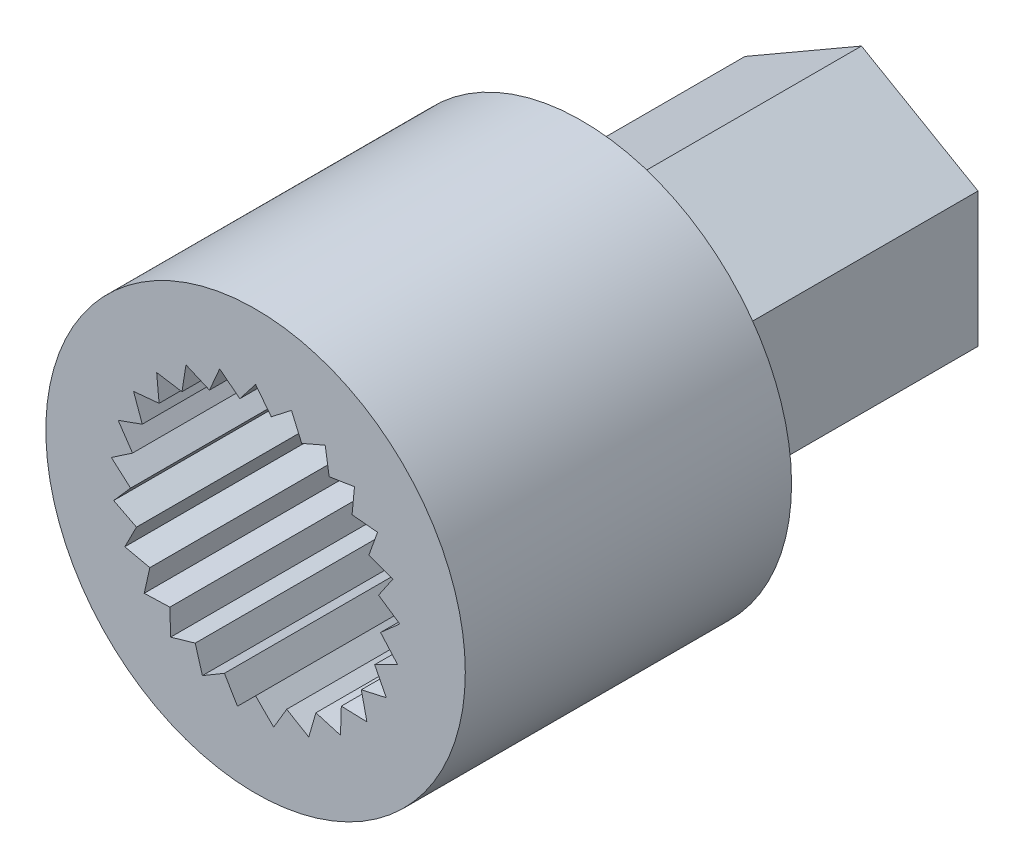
ISO-10303-21;
HEADER;
FILE_DESCRIPTION(('STEP AP214'),'2;1');
FILE_NAME('part.step','',(''),(''),'','','');
FILE_SCHEMA(('AUTOMOTIVE_DESIGN { 1 0 10303 214 1 1 1 1 }'));
ENDSEC;
DATA;
#1=APPLICATION_CONTEXT('core data for automotive mechanical design processes');
#2=APPLICATION_PROTOCOL_DEFINITION('international standard','automotive_design',2000,#1);
#3=PRODUCT_CONTEXT('',#1,'mechanical');
#4=PRODUCT('Part','Part','',(#3));
#5=PRODUCT_RELATED_PRODUCT_CATEGORY('part','',(#4));
#6=PRODUCT_DEFINITION_FORMATION('','',#4);
#7=PRODUCT_DEFINITION_CONTEXT('part definition',#1,'design');
#8=PRODUCT_DEFINITION('design','',#6,#7);
#9=PRODUCT_DEFINITION_SHAPE('','',#8);
#10=(LENGTH_UNIT() NAMED_UNIT(*) SI_UNIT(.MILLI.,.METRE.));
#11=(NAMED_UNIT(*) PLANE_ANGLE_UNIT() SI_UNIT($,.RADIAN.));
#12=(NAMED_UNIT(*) SI_UNIT($,.STERADIAN.) SOLID_ANGLE_UNIT());
#13=UNCERTAINTY_MEASURE_WITH_UNIT(LENGTH_MEASURE(1.E-05),#10,'distance_accuracy_value','');
#14=(GEOMETRIC_REPRESENTATION_CONTEXT(3) GLOBAL_UNCERTAINTY_ASSIGNED_CONTEXT((#13)) GLOBAL_UNIT_ASSIGNED_CONTEXT((#10,
#11,#12)) REPRESENTATION_CONTEXT('',''));
#15=CARTESIAN_POINT('',(0.,0.,0.));
#16=DIRECTION('',(0.,0.,1.));
#17=DIRECTION('',(1.,0.,0.));
#18=AXIS2_PLACEMENT_3D('',#15,#16,#17);
#19=CARTESIAN_POINT('',(0.,0.,-1.));
#20=DIRECTION('',(0.,0.,1.));
#21=DIRECTION('',(1.,0.,0.));
#22=AXIS2_PLACEMENT_3D('',#19,#20,#21);
#23=PLANE('',#22);
#24=CARTESIAN_POINT('',(0.,0.,-1.));
#25=DIRECTION('',(0.,0.,1.));
#26=DIRECTION('',(1.,0.,0.));
#27=AXIS2_PLACEMENT_3D('',#24,#25,#26);
#28=CIRCLE('',#27,2.25);
#29=CARTESIAN_POINT('',(2.25,0.,-1.));
#30=VERTEX_POINT('',#29);
#31=EDGE_CURVE('E416',#30,#30,#28,.T.);
#32=ORIENTED_EDGE('',*,*,#31,.F.);
#33=EDGE_LOOP('',(#32));
#34=FACE_BOUND('',#33,.T.);
#35=DIRECTION('',(-0.866025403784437,0.500000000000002,0.));
#36=VECTOR('',#35,1.);
#37=CARTESIAN_POINT('',(-1.24999999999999,-0.721687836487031,-1.));
#38=LINE('',#37,#36);
#39=CARTESIAN_POINT('',(0.,-1.44337567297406,-1.));
#40=VERTEX_POINT('',#39);
#41=CARTESIAN_POINT('',(-1.24999999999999,-0.721687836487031,-1.));
#42=VERTEX_POINT('',#41);
#43=EDGE_CURVE('E58',#40,#42,#38,.T.);
#44=ORIENTED_EDGE('',*,*,#43,.F.);
#45=DIRECTION('',(-0.86602540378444,-0.499999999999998,0.));
#46=VECTOR('',#45,1.);
#47=CARTESIAN_POINT('',(0.,-1.44337567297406,-1.));
#48=LINE('',#47,#46);
#49=CARTESIAN_POINT('',(1.25,-0.721687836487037,-1.));
#50=VERTEX_POINT('',#49);
#51=EDGE_CURVE('E62',#50,#40,#48,.T.);
#52=ORIENTED_EDGE('',*,*,#51,.F.);
#53=DIRECTION('',(0.,-1.,0.));
#54=VECTOR('',#53,1.);
#55=CARTESIAN_POINT('',(1.25,-0.721687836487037,-1.));
#56=LINE('',#55,#54);
#57=CARTESIAN_POINT('',(1.25,0.721687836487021,-1.));
#58=VERTEX_POINT('',#57);
#59=EDGE_CURVE('E1530',#58,#50,#56,.T.);
#60=ORIENTED_EDGE('',*,*,#59,.F.);
#61=DIRECTION('',(0.866025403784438,-0.500000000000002,0.));
#62=VECTOR('',#61,1.);
#63=CARTESIAN_POINT('',(1.25,0.721687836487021,-1.));
#64=LINE('',#63,#62);
#65=CARTESIAN_POINT('',(0.,1.44337567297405,-1.));
#66=VERTEX_POINT('',#65);
#67=EDGE_CURVE('E1545',#66,#58,#64,.T.);
#68=ORIENTED_EDGE('',*,*,#67,.F.);
#69=DIRECTION('',(0.86602540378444,0.499999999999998,0.));
#70=VECTOR('',#69,1.);
#71=CARTESIAN_POINT('',(0.,1.44337567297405,-1.));
#72=LINE('',#71,#70);
#73=CARTESIAN_POINT('',(-1.24999999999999,0.721687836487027,-1.));
#74=VERTEX_POINT('',#73);
#75=EDGE_CURVE('E1548',#74,#66,#72,.T.);
#76=ORIENTED_EDGE('',*,*,#75,.F.);
#77=DIRECTION('',(0.,1.,0.));
#78=VECTOR('',#77,1.);
#79=CARTESIAN_POINT('',(-1.24999999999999,0.721687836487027,-1.));
#80=LINE('',#79,#78);
#81=EDGE_CURVE('E1549',#42,#74,#80,.T.);
#82=ORIENTED_EDGE('',*,*,#81,.F.);
#83=EDGE_LOOP('',(#44,#52,#60,#68,#76,#82));
#84=FACE_BOUND('',#83,.T.);
#85=ADVANCED_FACE('F43',(#34,#84),#23,.F.);
#86=CARTESIAN_POINT('',(0.582265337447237,0.750651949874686,2.5));
#87=DIRECTION('',(0.612907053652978,0.790155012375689,0.));
#88=DIRECTION('',(-0.790155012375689,0.612907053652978,0.));
#89=AXIS2_PLACEMENT_3D('',#86,#87,#88);
#90=PLANE('',#89);
#91=DIRECTION('',(0.790155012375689,-0.612907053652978,0.));
#92=VECTOR('',#91,1.);
#93=CARTESIAN_POINT('',(0.582265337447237,0.750651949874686,0.));
#94=LINE('',#93,#92);
#95=CARTESIAN_POINT('',(-0.385469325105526,1.50130389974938,0.));
#96=VERTEX_POINT('',#95);
#97=CARTESIAN_POINT('',(-0.168386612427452,1.33291728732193,0.));
#98=VERTEX_POINT('',#97);
#99=EDGE_CURVE('E419',#96,#98,#94,.T.);
#100=ORIENTED_EDGE('',*,*,#99,.T.);
#101=DIRECTION('',(0.,0.,-1.));
#102=VECTOR('',#101,1.);
#103=CARTESIAN_POINT('',(-0.168386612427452,1.33291728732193,2.5));
#104=LINE('',#103,#102);
#105=CARTESIAN_POINT('',(-0.168386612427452,1.33291728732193,2.5));
#106=VERTEX_POINT('',#105);
#107=EDGE_CURVE('E11',#106,#98,#104,.T.);
#108=ORIENTED_EDGE('',*,*,#107,.F.);
#109=DIRECTION('',(0.790155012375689,-0.612907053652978,0.));
#110=VECTOR('',#109,1.);
#111=CARTESIAN_POINT('',(0.582265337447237,0.750651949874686,2.5));
#112=LINE('',#111,#110);
#113=CARTESIAN_POINT('',(-0.385469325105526,1.50130389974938,2.5));
#114=VERTEX_POINT('',#113);
#115=EDGE_CURVE('E425',#114,#106,#112,.T.);
#116=ORIENTED_EDGE('',*,*,#115,.F.);
#117=DIRECTION('',(0.,0.,-1.));
#118=VECTOR('',#117,1.);
#119=CARTESIAN_POINT('',(-0.385469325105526,1.50130389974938,2.5));
#120=LINE('',#119,#118);
#121=EDGE_CURVE('E530',#114,#96,#120,.T.);
#122=ORIENTED_EDGE('',*,*,#121,.T.);
#123=EDGE_LOOP('',(#100,#108,#116,#122));
#124=FACE_BOUND('',#123,.T.);
#125=ADVANCED_FACE('F45',(#124),#90,.F.);
#126=CARTESIAN_POINT('',(-0.750651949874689,0.582265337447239,2.5));
#127=DIRECTION('',(-0.79015501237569,0.612907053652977,0.));
#128=DIRECTION('',(-0.612907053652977,-0.79015501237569,0.));
#129=AXIS2_PLACEMENT_3D('',#126,#127,#128);
#130=PLANE('',#129);
#131=DIRECTION('',(0.612907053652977,0.79015501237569,0.));
#132=VECTOR('',#131,1.);
#133=CARTESIAN_POINT('',(-0.750651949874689,0.582265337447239,0.));
#134=LINE('',#133,#132);
#135=CARTESIAN_POINT('',(0.,1.55,0.));
#136=VERTEX_POINT('',#135);
#137=EDGE_CURVE('E533',#98,#136,#134,.T.);
#138=ORIENTED_EDGE('',*,*,#137,.T.);
#139=DIRECTION('',(0.,0.,-1.));
#140=VECTOR('',#139,1.);
#141=CARTESIAN_POINT('',(0.,1.55,2.5));
#142=LINE('',#141,#140);
#143=CARTESIAN_POINT('',(0.,1.55,2.5));
#144=VERTEX_POINT('',#143);
#145=EDGE_CURVE('E51',#144,#136,#142,.T.);
#146=ORIENTED_EDGE('',*,*,#145,.F.);
#147=DIRECTION('',(0.612907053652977,0.79015501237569,0.));
#148=VECTOR('',#147,1.);
#149=CARTESIAN_POINT('',(-0.750651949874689,0.582265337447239,2.5));
#150=LINE('',#149,#148);
#151=EDGE_CURVE('E428',#106,#144,#150,.T.);
#152=ORIENTED_EDGE('',*,*,#151,.F.);
#153=ORIENTED_EDGE('',*,*,#107,.T.);
#154=EDGE_LOOP('',(#138,#146,#152,#153));
#155=FACE_BOUND('',#154,.T.);
#156=ADVANCED_FACE('F828',(#155),#130,.F.);
#157=CARTESIAN_POINT('',(0.750651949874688,0.582265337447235,2.5));
#158=DIRECTION('',(0.790155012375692,0.612907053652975,0.));
#159=DIRECTION('',(-0.612907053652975,0.790155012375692,0.));
#160=AXIS2_PLACEMENT_3D('',#157,#158,#159);
#161=PLANE('',#160);
#162=DIRECTION('',(0.612907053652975,-0.790155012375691,0.));
#163=VECTOR('',#162,1.);
#164=CARTESIAN_POINT('',(0.750651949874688,0.582265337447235,0.));
#165=LINE('',#164,#163);
#166=CARTESIAN_POINT('',(0.168386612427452,1.33291728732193,0.));
#167=VERTEX_POINT('',#166);
#168=EDGE_CURVE('E536',#136,#167,#165,.T.);
#169=ORIENTED_EDGE('',*,*,#168,.T.);
#170=DIRECTION('',(0.,0.,-1.));
#171=VECTOR('',#170,1.);
#172=CARTESIAN_POINT('',(0.168386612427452,1.33291728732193,2.5));
#173=LINE('',#172,#171);
#174=CARTESIAN_POINT('',(0.168386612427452,1.33291728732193,2.5));
#175=VERTEX_POINT('',#174);
#176=EDGE_CURVE('E819',#175,#167,#173,.T.);
#177=ORIENTED_EDGE('',*,*,#176,.F.);
#178=DIRECTION('',(0.612907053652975,-0.790155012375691,0.));
#179=VECTOR('',#178,1.);
#180=CARTESIAN_POINT('',(0.750651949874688,0.582265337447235,2.5));
#181=LINE('',#180,#179);
#182=EDGE_CURVE('E431',#144,#175,#181,.T.);
#183=ORIENTED_EDGE('',*,*,#182,.F.);
#184=ORIENTED_EDGE('',*,*,#145,.T.);
#185=EDGE_LOOP('',(#169,#177,#183,#184));
#186=FACE_BOUND('',#185,.T.);
#187=ADVANCED_FACE('F825',(#186),#161,.F.);
#188=CARTESIAN_POINT('',(-0.582265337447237,0.750651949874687,2.5));
#189=DIRECTION('',(-0.612907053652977,0.79015501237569,0.));
#190=DIRECTION('',(-0.79015501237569,-0.612907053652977,0.));
#191=AXIS2_PLACEMENT_3D('',#188,#189,#190);
#192=PLANE('',#191);
#193=DIRECTION('',(0.79015501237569,0.612907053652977,0.));
#194=VECTOR('',#193,1.);
#195=CARTESIAN_POINT('',(-0.582265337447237,0.750651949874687,0.));
#196=LINE('',#195,#194);
#197=CARTESIAN_POINT('',(0.385469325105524,1.50130389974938,0.));
#198=VERTEX_POINT('',#197);
#199=EDGE_CURVE('E539',#167,#198,#196,.T.);
#200=ORIENTED_EDGE('',*,*,#199,.T.);
#201=DIRECTION('',(0.,0.,-1.));
#202=VECTOR('',#201,1.);
#203=CARTESIAN_POINT('',(0.385469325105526,1.50130389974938,2.5));
#204=LINE('',#203,#202);
#205=CARTESIAN_POINT('',(0.385469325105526,1.50130389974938,2.5));
#206=VERTEX_POINT('',#205);
#207=EDGE_CURVE('E816',#206,#198,#204,.T.);
#208=ORIENTED_EDGE('',*,*,#207,.F.);
#209=DIRECTION('',(0.79015501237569,0.612907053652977,0.));
#210=VECTOR('',#209,1.);
#211=CARTESIAN_POINT('',(-0.582265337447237,0.750651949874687,2.5));
#212=LINE('',#211,#210);
#213=EDGE_CURVE('E433',#175,#206,#212,.T.);
#214=ORIENTED_EDGE('',*,*,#213,.F.);
#215=ORIENTED_EDGE('',*,*,#176,.T.);
#216=EDGE_LOOP('',(#200,#208,#214,#215));
#217=FACE_BOUND('',#216,.T.);
#218=ADVANCED_FACE('F834',(#217),#192,.F.);
#219=CARTESIAN_POINT('',(0.871872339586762,0.37729285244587,2.5));
#220=DIRECTION('',(0.917754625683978,0.397147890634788,0.));
#221=DIRECTION('',(-0.397147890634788,0.917754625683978,0.));
#222=AXIS2_PLACEMENT_3D('',#219,#220,#221);
#223=PLANE('',#222);
#224=DIRECTION('',(0.397147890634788,-0.917754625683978,0.));
#225=VECTOR('',#224,1.);
#226=CARTESIAN_POINT('',(0.871872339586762,0.37729285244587,0.));
#227=LINE('',#226,#225);
#228=CARTESIAN_POINT('',(0.494579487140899,1.24916519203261,0.));
#229=VERTEX_POINT('',#228);
#230=EDGE_CURVE('E542',#198,#229,#227,.T.);
#231=ORIENTED_EDGE('',*,*,#230,.T.);
#232=DIRECTION('',(0.,0.,-1.));
#233=VECTOR('',#232,1.);
#234=CARTESIAN_POINT('',(0.494579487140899,1.24916519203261,2.5));
#235=LINE('',#234,#233);
#236=CARTESIAN_POINT('',(0.494579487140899,1.24916519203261,2.5));
#237=VERTEX_POINT('',#236);
#238=EDGE_CURVE('E813',#237,#229,#235,.T.);
#239=ORIENTED_EDGE('',*,*,#238,.F.);
#240=DIRECTION('',(0.397147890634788,-0.917754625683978,0.));
#241=VECTOR('',#240,1.);
#242=CARTESIAN_POINT('',(0.871872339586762,0.37729285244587,2.5));
#243=LINE('',#242,#241);
#244=EDGE_CURVE('E435',#206,#237,#243,.T.);
#245=ORIENTED_EDGE('',*,*,#244,.F.);
#246=ORIENTED_EDGE('',*,*,#207,.T.);
#247=EDGE_LOOP('',(#231,#239,#245,#246));
#248=FACE_BOUND('',#247,.T.);
#249=ADVANCED_FACE('F838',(#248),#223,.F.);
#250=CARTESIAN_POINT('',(-0.377292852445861,0.87187233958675,2.5));
#251=DIRECTION('',(-0.397147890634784,0.91775462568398,0.));
#252=DIRECTION('',(-0.91775462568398,-0.397147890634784,0.));
#253=AXIS2_PLACEMENT_3D('',#250,#251,#252);
#254=PLANE('',#253);
#255=DIRECTION('',(0.91775462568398,0.397147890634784,0.));
#256=VECTOR('',#255,1.);
#257=CARTESIAN_POINT('',(-0.377292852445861,0.87187233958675,0.));
#258=LINE('',#257,#256);
#259=CARTESIAN_POINT('',(0.746718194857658,1.35827535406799,0.));
#260=VERTEX_POINT('',#259);
#261=EDGE_CURVE('E545',#229,#260,#258,.T.);
#262=ORIENTED_EDGE('',*,*,#261,.T.);
#263=DIRECTION('',(0.,0.,-1.));
#264=VECTOR('',#263,1.);
#265=CARTESIAN_POINT('',(0.746718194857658,1.35827535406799,2.5));
#266=LINE('',#265,#264);
#267=CARTESIAN_POINT('',(0.746718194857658,1.35827535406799,2.5));
#268=VERTEX_POINT('',#267);
#269=EDGE_CURVE('E810',#268,#260,#266,.T.);
#270=ORIENTED_EDGE('',*,*,#269,.F.);
#271=DIRECTION('',(0.91775462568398,0.397147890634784,0.));
#272=VECTOR('',#271,1.);
#273=CARTESIAN_POINT('',(-0.377292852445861,0.87187233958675,2.5));
#274=LINE('',#273,#272);
#275=EDGE_CURVE('E437',#237,#268,#274,.T.);
#276=ORIENTED_EDGE('',*,*,#275,.F.);
#277=ORIENTED_EDGE('',*,*,#238,.T.);
#278=EDGE_LOOP('',(#262,#270,#276,#277));
#279=FACE_BOUND('',#278,.T.);
#280=ADVANCED_FACE('F1024',(#279),#254,.F.);
#281=CARTESIAN_POINT('',(0.938309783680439,0.148613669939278,2.5));
#282=DIRECTION('',(0.987688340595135,0.156434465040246,0.));
#283=DIRECTION('',(-0.156434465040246,0.987688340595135,0.));
#284=AXIS2_PLACEMENT_3D('',#281,#282,#283);
#285=PLANE('',#284);
#286=DIRECTION('',(0.156434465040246,-0.987688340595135,0.));
#287=VECTOR('',#286,1.);
#288=CARTESIAN_POINT('',(0.938309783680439,0.148613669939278,0.));
#289=LINE('',#288,#287);
#290=CARTESIAN_POINT('',(0.789696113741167,1.08692345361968,0.));
#291=VERTEX_POINT('',#290);
#292=EDGE_CURVE('E548',#260,#291,#289,.T.);
#293=ORIENTED_EDGE('',*,*,#292,.T.);
#294=DIRECTION('',(0.,0.,-1.));
#295=VECTOR('',#294,1.);
#296=CARTESIAN_POINT('',(0.789696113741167,1.08692345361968,2.5));
#297=LINE('',#296,#295);
#298=CARTESIAN_POINT('',(0.789696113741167,1.08692345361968,2.5));
#299=VERTEX_POINT('',#298);
#300=EDGE_CURVE('E807',#299,#291,#297,.T.);
#301=ORIENTED_EDGE('',*,*,#300,.F.);
#302=DIRECTION('',(0.156434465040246,-0.987688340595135,0.));
#303=VECTOR('',#302,1.);
#304=CARTESIAN_POINT('',(0.938309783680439,0.148613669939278,2.5));
#305=LINE('',#304,#303);
#306=EDGE_CURVE('E439',#268,#299,#305,.T.);
#307=ORIENTED_EDGE('',*,*,#306,.F.);
#308=ORIENTED_EDGE('',*,*,#269,.T.);
#309=EDGE_LOOP('',(#293,#301,#307,#308));
#310=FACE_BOUND('',#309,.T.);
#311=ADVANCED_FACE('F1021',(#310),#285,.F.);
#312=CARTESIAN_POINT('',(-0.148613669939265,0.938309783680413,2.5));
#313=DIRECTION('',(-0.156434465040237,0.987688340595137,0.));
#314=DIRECTION('',(-0.987688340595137,-0.156434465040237,0.));
#315=AXIS2_PLACEMENT_3D('',#312,#313,#314);
#316=PLANE('',#315);
#317=DIRECTION('',(0.987688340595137,0.156434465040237,0.));
#318=VECTOR('',#317,1.);
#319=CARTESIAN_POINT('',(-0.148613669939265,0.938309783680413,0.));
#320=LINE('',#319,#318);
#321=CARTESIAN_POINT('',(1.06104801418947,1.12990137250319,0.));
#322=VERTEX_POINT('',#321);
#323=EDGE_CURVE('E551',#291,#322,#320,.T.);
#324=ORIENTED_EDGE('',*,*,#323,.T.);
#325=DIRECTION('',(0.,0.,-1.));
#326=VECTOR('',#325,1.);
#327=CARTESIAN_POINT('',(1.06104801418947,1.12990137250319,2.5));
#328=LINE('',#327,#326);
#329=CARTESIAN_POINT('',(1.06104801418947,1.12990137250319,2.5));
#330=VERTEX_POINT('',#329);
#331=EDGE_CURVE('E804',#330,#322,#328,.T.);
#332=ORIENTED_EDGE('',*,*,#331,.F.);
#333=DIRECTION('',(0.987688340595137,0.156434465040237,0.));
#334=VECTOR('',#333,1.);
#335=CARTESIAN_POINT('',(-0.148613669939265,0.938309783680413,2.5));
#336=LINE('',#335,#334);
#337=EDGE_CURVE('E441',#299,#330,#336,.T.);
#338=ORIENTED_EDGE('',*,*,#337,.F.);
#339=ORIENTED_EDGE('',*,*,#300,.T.);
#340=EDGE_LOOP('',(#324,#332,#338,#339));
#341=FACE_BOUND('',#340,.T.);
#342=ADVANCED_FACE('F1018',(#341),#316,.F.);
#343=CARTESIAN_POINT('',(0.945789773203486,-0.0894034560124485,2.5));
#344=DIRECTION('',(0.995561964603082,-0.0941083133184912,0.));
#345=DIRECTION('',(0.0941083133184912,0.995561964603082,0.));
#346=AXIS2_PLACEMENT_3D('',#343,#344,#345);
#347=PLANE('',#346);
#348=DIRECTION('',(-0.0941083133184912,-0.995561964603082,0.));
#349=VECTOR('',#348,1.);
#350=CARTESIAN_POINT('',(0.945789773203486,-0.0894034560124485,0.));
#351=LINE('',#350,#349);
#352=CARTESIAN_POINT('',(1.03519322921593,0.856386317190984,0.));
#353=VERTEX_POINT('',#352);
#354=EDGE_CURVE('E554',#322,#353,#351,.T.);
#355=ORIENTED_EDGE('',*,*,#354,.T.);
#356=DIRECTION('',(0.,0.,-1.));
#357=VECTOR('',#356,1.);
#358=CARTESIAN_POINT('',(1.03519322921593,0.856386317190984,2.5));
#359=LINE('',#358,#357);
#360=CARTESIAN_POINT('',(1.03519322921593,0.856386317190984,2.5));
#361=VERTEX_POINT('',#360);
#362=EDGE_CURVE('E801',#361,#353,#359,.T.);
#363=ORIENTED_EDGE('',*,*,#362,.F.);
#364=DIRECTION('',(-0.0941083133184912,-0.995561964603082,0.));
#365=VECTOR('',#364,1.);
#366=CARTESIAN_POINT('',(0.945789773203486,-0.0894034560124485,2.5));
#367=LINE('',#366,#365);
#368=EDGE_CURVE('E443',#330,#361,#367,.T.);
#369=ORIENTED_EDGE('',*,*,#368,.F.);
#370=ORIENTED_EDGE('',*,*,#331,.T.);
#371=EDGE_LOOP('',(#355,#363,#369,#370));
#372=FACE_BOUND('',#371,.T.);
#373=ADVANCED_FACE('F1013',(#372),#347,.F.);
#374=CARTESIAN_POINT('',(0.0894034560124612,0.945789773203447,2.5));
#375=DIRECTION('',(0.0941083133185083,0.995561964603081,0.));
#376=DIRECTION('',(-0.995561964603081,0.0941083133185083,0.));
#377=AXIS2_PLACEMENT_3D('',#374,#375,#376);
#378=PLANE('',#377);
#379=DIRECTION('',(0.995561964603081,-0.0941083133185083,0.));
#380=VECTOR('',#379,1.);
#381=CARTESIAN_POINT('',(0.0894034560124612,0.945789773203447,0.));
#382=LINE('',#381,#380);
#383=CARTESIAN_POINT('',(1.30870828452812,0.830531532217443,0.));
#384=VERTEX_POINT('',#383);
#385=EDGE_CURVE('E557',#353,#384,#382,.T.);
#386=ORIENTED_EDGE('',*,*,#385,.T.);
#387=DIRECTION('',(0.,0.,-1.));
#388=VECTOR('',#387,1.);
#389=CARTESIAN_POINT('',(1.30870828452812,0.830531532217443,2.5));
#390=LINE('',#389,#388);
#391=CARTESIAN_POINT('',(1.30870828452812,0.830531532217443,2.5));
#392=VERTEX_POINT('',#391);
#393=EDGE_CURVE('E798',#392,#384,#390,.T.);
#394=ORIENTED_EDGE('',*,*,#393,.F.);
#395=DIRECTION('',(0.995561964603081,-0.0941083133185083,0.));
#396=VECTOR('',#395,1.);
#397=CARTESIAN_POINT('',(0.0894034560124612,0.945789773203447,2.5));
#398=LINE('',#397,#396);
#399=EDGE_CURVE('E445',#361,#392,#398,.T.);
#400=ORIENTED_EDGE('',*,*,#399,.F.);
#401=ORIENTED_EDGE('',*,*,#362,.T.);
#402=EDGE_LOOP('',(#386,#394,#400,#401));
#403=FACE_BOUND('',#402,.T.);
#404=ADVANCED_FACE('F1010',(#403),#378,.F.);
#405=CARTESIAN_POINT('',(0.89384231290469,-0.321803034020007,2.5));
#406=DIRECTION('',(0.940880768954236,-0.338737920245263,0.));
#407=DIRECTION('',(0.338737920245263,0.940880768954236,0.));
#408=AXIS2_PLACEMENT_3D('',#405,#406,#407);
#409=PLANE('',#408);
#410=DIRECTION('',(-0.338737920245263,-0.940880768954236,0.));
#411=VECTOR('',#410,1.);
#412=CARTESIAN_POINT('',(0.89384231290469,-0.321803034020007,0.));
#413=LINE('',#412,#411);
#414=CARTESIAN_POINT('',(1.21564534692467,0.572039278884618,0.));
#415=VERTEX_POINT('',#414);
#416=EDGE_CURVE('E560',#384,#415,#413,.T.);
#417=ORIENTED_EDGE('',*,*,#416,.T.);
#418=DIRECTION('',(0.,0.,-1.));
#419=VECTOR('',#418,1.);
#420=CARTESIAN_POINT('',(1.21564534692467,0.572039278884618,2.5));
#421=LINE('',#420,#419);
#422=CARTESIAN_POINT('',(1.21564534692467,0.572039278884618,2.5));
#423=VERTEX_POINT('',#422);
#424=EDGE_CURVE('E795',#423,#415,#421,.T.);
#425=ORIENTED_EDGE('',*,*,#424,.F.);
#426=DIRECTION('',(-0.338737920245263,-0.940880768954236,0.));
#427=VECTOR('',#426,1.);
#428=CARTESIAN_POINT('',(0.89384231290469,-0.321803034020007,2.5));
#429=LINE('',#428,#427);
#430=EDGE_CURVE('E447',#392,#423,#429,.T.);
#431=ORIENTED_EDGE('',*,*,#430,.F.);
#432=ORIENTED_EDGE('',*,*,#393,.T.);
#433=EDGE_LOOP('',(#417,#425,#431,#432));
#434=FACE_BOUND('',#433,.T.);
#435=ADVANCED_FACE('F1005',(#434),#409,.F.);
#436=CARTESIAN_POINT('',(0.321803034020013,0.893842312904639,2.5));
#437=DIRECTION('',(0.338737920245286,0.940880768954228,0.));
#438=DIRECTION('',(-0.940880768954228,0.338737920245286,0.));
#439=AXIS2_PLACEMENT_3D('',#436,#437,#438);
#440=PLANE('',#439);
#441=DIRECTION('',(0.940880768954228,-0.338737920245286,0.));
#442=VECTOR('',#441,1.);
#443=CARTESIAN_POINT('',(0.321803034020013,0.893842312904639,0.));
#444=LINE('',#443,#442);
#445=CARTESIAN_POINT('',(1.47413760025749,0.478976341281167,0.));
#446=VERTEX_POINT('',#445);
#447=EDGE_CURVE('E563',#415,#446,#444,.T.);
#448=ORIENTED_EDGE('',*,*,#447,.T.);
#449=DIRECTION('',(0.,0.,-1.));
#450=VECTOR('',#449,1.);
#451=CARTESIAN_POINT('',(1.47413760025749,0.478976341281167,2.5));
#452=LINE('',#451,#450);
#453=CARTESIAN_POINT('',(1.47413760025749,0.478976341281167,2.5));
#454=VERTEX_POINT('',#453);
#455=EDGE_CURVE('E792',#454,#446,#452,.T.);
#456=ORIENTED_EDGE('',*,*,#455,.F.);
#457=DIRECTION('',(0.940880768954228,-0.338737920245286,0.));
#458=VECTOR('',#457,1.);
#459=CARTESIAN_POINT('',(0.321803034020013,0.893842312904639,2.5));
#460=LINE('',#459,#458);
#461=EDGE_CURVE('E449',#423,#454,#460,.T.);
#462=ORIENTED_EDGE('',*,*,#461,.F.);
#463=ORIENTED_EDGE('',*,*,#424,.T.);
#464=EDGE_LOOP('',(#448,#456,#462,#463));
#465=FACE_BOUND('',#464,.T.);
#466=ADVANCED_FACE('F1002',(#465),#440,.F.);
#467=CARTESIAN_POINT('',(0.785731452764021,-0.533982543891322,2.5));
#468=DIRECTION('',(0.827080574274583,-0.562083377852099,0.));
#469=DIRECTION('',(0.562083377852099,0.827080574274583,0.));
#470=AXIS2_PLACEMENT_3D('',#467,#468,#469);
#471=PLANE('',#470);
#472=DIRECTION('',(-0.562083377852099,-0.827080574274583,0.));
#473=VECTOR('',#472,1.);
#474=CARTESIAN_POINT('',(0.785731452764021,-0.533982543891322,0.));
#475=LINE('',#474,#473);
#476=CARTESIAN_POINT('',(1.31971399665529,0.251748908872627,0.));
#477=VERTEX_POINT('',#476);
#478=EDGE_CURVE('E566',#446,#477,#475,.T.);
#479=ORIENTED_EDGE('',*,*,#478,.T.);
#480=DIRECTION('',(0.,0.,-1.));
#481=VECTOR('',#480,1.);
#482=CARTESIAN_POINT('',(1.31971399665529,0.251748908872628,2.5));
#483=LINE('',#482,#481);
#484=CARTESIAN_POINT('',(1.31971399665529,0.251748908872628,2.5));
#485=VERTEX_POINT('',#484);
#486=EDGE_CURVE('E789',#485,#477,#483,.T.);
#487=ORIENTED_EDGE('',*,*,#486,.F.);
#488=DIRECTION('',(-0.562083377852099,-0.827080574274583,0.));
#489=VECTOR('',#488,1.);
#490=CARTESIAN_POINT('',(0.785731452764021,-0.533982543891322,2.5));
#491=LINE('',#490,#489);
#492=EDGE_CURVE('E451',#454,#485,#491,.T.);
#493=ORIENTED_EDGE('',*,*,#492,.F.);
#494=ORIENTED_EDGE('',*,*,#455,.T.);
#495=EDGE_LOOP('',(#479,#487,#493,#494));
#496=FACE_BOUND('',#495,.T.);
#497=ADVANCED_FACE('F997',(#496),#471,.F.);
#498=CARTESIAN_POINT('',(0.533982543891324,0.785731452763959,2.5));
#499=DIRECTION('',(0.56208337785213,0.827080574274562,0.));
#500=DIRECTION('',(-0.827080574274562,0.56208337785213,0.));
#501=AXIS2_PLACEMENT_3D('',#498,#499,#500);
#502=PLANE('',#501);
#503=DIRECTION('',(0.827080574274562,-0.56208337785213,0.));
#504=VECTOR('',#503,1.);
#505=CARTESIAN_POINT('',(0.533982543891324,0.785731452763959,0.));
#506=LINE('',#505,#504);
#507=CARTESIAN_POINT('',(1.54694142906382,0.0973253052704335,0.));
#508=VERTEX_POINT('',#507);
#509=EDGE_CURVE('E569',#477,#508,#506,.T.);
#510=ORIENTED_EDGE('',*,*,#509,.T.);
#511=DIRECTION('',(0.,0.,-1.));
#512=VECTOR('',#511,1.);
#513=CARTESIAN_POINT('',(1.54694142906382,0.0973253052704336,2.5));
#514=LINE('',#513,#512);
#515=CARTESIAN_POINT('',(1.54694142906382,0.0973253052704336,2.5));
#516=VERTEX_POINT('',#515);
#517=EDGE_CURVE('E786',#516,#508,#514,.T.);
#518=ORIENTED_EDGE('',*,*,#517,.F.);
#519=DIRECTION('',(0.827080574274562,-0.56208337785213,0.));
#520=VECTOR('',#519,1.);
#521=CARTESIAN_POINT('',(0.533982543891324,0.785731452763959,2.5));
#522=LINE('',#521,#520);
#523=EDGE_CURVE('E453',#485,#516,#522,.T.);
#524=ORIENTED_EDGE('',*,*,#523,.F.);
#525=ORIENTED_EDGE('',*,*,#486,.T.);
#526=EDGE_LOOP('',(#510,#518,#524,#525));
#527=FACE_BOUND('',#526,.T.);
#528=ADVANCED_FACE('F994',(#527),#502,.F.);
#529=CARTESIAN_POINT('',(0.628250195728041,-0.712609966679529,2.5));
#530=DIRECTION('',(0.661311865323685,-0.750111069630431,0.));
#531=DIRECTION('',(0.750111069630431,0.661311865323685,0.));
#532=AXIS2_PLACEMENT_3D('',#529,#530,#531);
#533=PLANE('',#532);
#534=DIRECTION('',(-0.750111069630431,-0.661311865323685,0.));
#535=VECTOR('',#534,1.);
#536=CARTESIAN_POINT('',(0.628250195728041,-0.712609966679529,0.));
#537=LINE('',#536,#535);
#538=CARTESIAN_POINT('',(1.3408601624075,-0.0843597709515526,0.));
#539=VERTEX_POINT('',#538);
#540=EDGE_CURVE('E572',#508,#539,#537,.T.);
#541=ORIENTED_EDGE('',*,*,#540,.T.);
#542=DIRECTION('',(0.,0.,-1.));
#543=VECTOR('',#542,1.);
#544=CARTESIAN_POINT('',(1.3408601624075,-0.0843597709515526,2.5));
#545=LINE('',#544,#543);
#546=CARTESIAN_POINT('',(1.3408601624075,-0.0843597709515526,2.5));
#547=VERTEX_POINT('',#546);
#548=EDGE_CURVE('E783',#547,#539,#545,.T.);
#549=ORIENTED_EDGE('',*,*,#548,.F.);
#550=DIRECTION('',(-0.750111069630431,-0.661311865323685,0.));
#551=VECTOR('',#550,1.);
#552=CARTESIAN_POINT('',(0.628250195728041,-0.712609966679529,2.5));
#553=LINE('',#552,#551);
#554=EDGE_CURVE('E455',#516,#547,#553,.T.);
#555=ORIENTED_EDGE('',*,*,#554,.F.);
#556=ORIENTED_EDGE('',*,*,#517,.T.);
#557=EDGE_LOOP('',(#541,#549,#555,#556));
#558=FACE_BOUND('',#557,.T.);
#559=ADVANCED_FACE('F989',(#558),#533,.F.);
#560=CARTESIAN_POINT('',(0.71260996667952,0.628250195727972,2.5));
#561=DIRECTION('',(0.750111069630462,0.661311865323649,0.));
#562=DIRECTION('',(-0.661311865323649,0.750111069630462,0.));
#563=AXIS2_PLACEMENT_3D('',#560,#561,#562);
#564=PLANE('',#563);
#565=DIRECTION('',(0.661311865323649,-0.750111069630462,0.));
#566=VECTOR('',#565,1.);
#567=CARTESIAN_POINT('',(0.71260996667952,0.628250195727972,0.));
#568=LINE('',#567,#566);
#569=CARTESIAN_POINT('',(1.52254523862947,-0.290441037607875,0.));
#570=VERTEX_POINT('',#569);
#571=EDGE_CURVE('E575',#539,#570,#568,.T.);
#572=ORIENTED_EDGE('',*,*,#571,.T.);
#573=DIRECTION('',(0.,0.,-1.));
#574=VECTOR('',#573,1.);
#575=CARTESIAN_POINT('',(1.52254523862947,-0.290441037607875,2.5));
#576=LINE('',#575,#574);
#577=CARTESIAN_POINT('',(1.52254523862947,-0.290441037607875,2.5));
#578=VERTEX_POINT('',#577);
#579=EDGE_CURVE('E780',#578,#570,#576,.T.);
#580=ORIENTED_EDGE('',*,*,#579,.F.);
#581=DIRECTION('',(0.661311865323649,-0.750111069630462,0.));
#582=VECTOR('',#581,1.);
#583=CARTESIAN_POINT('',(0.71260996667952,0.628250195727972,2.5));
#584=LINE('',#583,#582);
#585=EDGE_CURVE('E457',#547,#578,#584,.T.);
#586=ORIENTED_EDGE('',*,*,#585,.F.);
#587=ORIENTED_EDGE('',*,*,#548,.T.);
#588=EDGE_LOOP('',(#572,#580,#586,#587));
#589=FACE_BOUND('',#588,.T.);
#590=ADVANCED_FACE('F986',(#589),#564,.F.);
#591=CARTESIAN_POINT('',(0.43129366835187,-0.846461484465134,2.5));
#592=DIRECTION('',(0.45399049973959,-0.891006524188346,0.));
#593=DIRECTION('',(0.891006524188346,0.45399049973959,0.));
#594=AXIS2_PLACEMENT_3D('',#591,#592,#593);
#595=PLANE('',#594);
#596=DIRECTION('',(-0.891006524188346,-0.45399049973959,0.));
#597=VECTOR('',#596,1.);
#598=CARTESIAN_POINT('',(0.43129366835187,-0.846461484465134,0.));
#599=LINE('',#598,#597);
#600=CARTESIAN_POINT('',(1.27775515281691,-0.415167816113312,0.));
#601=VERTEX_POINT('',#600);
#602=EDGE_CURVE('E578',#570,#601,#599,.T.);
#603=ORIENTED_EDGE('',*,*,#602,.T.);
#604=DIRECTION('',(0.,0.,-1.));
#605=VECTOR('',#604,1.);
#606=CARTESIAN_POINT('',(1.27775515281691,-0.415167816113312,2.5));
#607=LINE('',#606,#605);
#608=CARTESIAN_POINT('',(1.27775515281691,-0.415167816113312,2.5));
#609=VERTEX_POINT('',#608);
#610=EDGE_CURVE('E777',#609,#601,#607,.T.);
#611=ORIENTED_EDGE('',*,*,#610,.F.);
#612=DIRECTION('',(-0.891006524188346,-0.45399049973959,0.));
#613=VECTOR('',#612,1.);
#614=CARTESIAN_POINT('',(0.43129366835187,-0.846461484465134,2.5));
#615=LINE('',#614,#613);
#616=EDGE_CURVE('E459',#578,#609,#615,.T.);
#617=ORIENTED_EDGE('',*,*,#616,.F.);
#618=ORIENTED_EDGE('',*,*,#579,.T.);
#619=EDGE_LOOP('',(#603,#611,#617,#618));
#620=FACE_BOUND('',#619,.T.);
#621=ADVANCED_FACE('F981',(#620),#595,.F.);
#622=CARTESIAN_POINT('',(0.846461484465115,0.431293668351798,2.5));
#623=DIRECTION('',(0.891006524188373,0.453990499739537,0.));
#624=DIRECTION('',(-0.453990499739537,0.891006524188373,0.));
#625=AXIS2_PLACEMENT_3D('',#622,#623,#624);
#626=PLANE('',#625);
#627=DIRECTION('',(0.453990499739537,-0.891006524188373,0.));
#628=VECTOR('',#627,1.);
#629=CARTESIAN_POINT('',(0.846461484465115,0.431293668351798,0.));
#630=LINE('',#629,#628);
#631=CARTESIAN_POINT('',(1.40248193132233,-0.659957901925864,0.));
#632=VERTEX_POINT('',#631);
#633=EDGE_CURVE('E581',#601,#632,#630,.T.);
#634=ORIENTED_EDGE('',*,*,#633,.T.);
#635=DIRECTION('',(0.,0.,-1.));
#636=VECTOR('',#635,1.);
#637=CARTESIAN_POINT('',(1.40248193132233,-0.659957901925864,2.5));
#638=LINE('',#637,#636);
#639=CARTESIAN_POINT('',(1.40248193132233,-0.659957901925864,2.5));
#640=VERTEX_POINT('',#639);
#641=EDGE_CURVE('E774',#640,#632,#638,.T.);
#642=ORIENTED_EDGE('',*,*,#641,.F.);
#643=DIRECTION('',(0.453990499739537,-0.891006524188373,0.));
#644=VECTOR('',#643,1.);
#645=CARTESIAN_POINT('',(0.846461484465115,0.431293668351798,2.5));
#646=LINE('',#645,#644);
#647=EDGE_CURVE('E461',#609,#640,#646,.T.);
#648=ORIENTED_EDGE('',*,*,#647,.F.);
#649=ORIENTED_EDGE('',*,*,#610,.T.);
#650=EDGE_LOOP('',(#634,#642,#648,#649));
#651=FACE_BOUND('',#650,.T.);
#652=ADVANCED_FACE('F978',(#651),#626,.F.);
#653=CARTESIAN_POINT('',(0.207237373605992,-0.927126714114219,2.5));
#654=DIRECTION('',(0.218143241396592,-0.975916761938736,0.));
#655=DIRECTION('',(0.975916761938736,0.218143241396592,0.));
#656=AXIS2_PLACEMENT_3D('',#653,#654,#655);
#657=PLANE('',#656);
#658=DIRECTION('',(-0.975916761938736,-0.218143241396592,0.));
#659=VECTOR('',#658,1.);
#660=CARTESIAN_POINT('',(0.207237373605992,-0.927126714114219,0.));
#661=LINE('',#660,#659);
#662=CARTESIAN_POINT('',(1.1343640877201,-0.719889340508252,0.));
#663=VERTEX_POINT('',#662);
#664=EDGE_CURVE('E584',#632,#663,#661,.T.);
#665=ORIENTED_EDGE('',*,*,#664,.T.);
#666=DIRECTION('',(0.,0.,-1.));
#667=VECTOR('',#666,1.);
#668=CARTESIAN_POINT('',(1.1343640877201,-0.719889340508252,2.5));
#669=LINE('',#668,#667);
#670=CARTESIAN_POINT('',(1.1343640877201,-0.719889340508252,2.5));
#671=VERTEX_POINT('',#670);
#672=EDGE_CURVE('E771',#671,#663,#669,.T.);
#673=ORIENTED_EDGE('',*,*,#672,.F.);
#674=DIRECTION('',(-0.975916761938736,-0.218143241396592,0.));
#675=VECTOR('',#674,1.);
#676=CARTESIAN_POINT('',(0.207237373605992,-0.927126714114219,2.5));
#677=LINE('',#676,#675);
#678=EDGE_CURVE('E463',#640,#671,#677,.T.);
#679=ORIENTED_EDGE('',*,*,#678,.F.);
#680=ORIENTED_EDGE('',*,*,#641,.T.);
#681=EDGE_LOOP('',(#665,#673,#679,#680));
#682=FACE_BOUND('',#681,.T.);
#683=ADVANCED_FACE('F973',(#682),#657,.F.);
#684=CARTESIAN_POINT('',(0.92712671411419,0.207237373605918,2.5));
#685=DIRECTION('',(0.975916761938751,0.218143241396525,0.));
#686=DIRECTION('',(-0.218143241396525,0.975916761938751,0.));
#687=AXIS2_PLACEMENT_3D('',#684,#685,#686);
#688=PLANE('',#687);
#689=DIRECTION('',(0.218143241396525,-0.975916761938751,0.));
#690=VECTOR('',#689,1.);
#691=CARTESIAN_POINT('',(0.92712671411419,0.207237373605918,0.));
#692=LINE('',#691,#690);
#693=CARTESIAN_POINT('',(1.19429552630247,-0.98800718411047,0.));
#694=VERTEX_POINT('',#693);
#695=EDGE_CURVE('E587',#663,#694,#692,.T.);
#696=ORIENTED_EDGE('',*,*,#695,.T.);
#697=DIRECTION('',(0.,0.,-1.));
#698=VECTOR('',#697,1.);
#699=CARTESIAN_POINT('',(1.19429552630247,-0.98800718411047,2.5));
#700=LINE('',#699,#698);
#701=CARTESIAN_POINT('',(1.19429552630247,-0.98800718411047,2.5));
#702=VERTEX_POINT('',#701);
#703=EDGE_CURVE('E768',#702,#694,#700,.T.);
#704=ORIENTED_EDGE('',*,*,#703,.F.);
#705=DIRECTION('',(0.218143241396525,-0.975916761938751,0.));
#706=VECTOR('',#705,1.);
#707=CARTESIAN_POINT('',(0.92712671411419,0.207237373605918,2.5));
#708=LINE('',#707,#706);
#709=EDGE_CURVE('E465',#671,#702,#708,.T.);
#710=ORIENTED_EDGE('',*,*,#709,.F.);
#711=ORIENTED_EDGE('',*,*,#672,.T.);
#712=EDGE_LOOP('',(#696,#704,#710,#711));
#713=FACE_BOUND('',#712,.T.);
#714=ADVANCED_FACE('F970',(#713),#688,.F.);
#715=CARTESIAN_POINT('',(-0.0298404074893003,-0.949537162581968,2.5));
#716=DIRECTION('',(-0.0314107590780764,-0.999506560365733,0.));
#717=DIRECTION('',(0.999506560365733,-0.0314107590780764,0.));
#718=AXIS2_PLACEMENT_3D('',#715,#716,#717);
#719=PLANE('',#718);
#720=DIRECTION('',(-0.999506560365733,0.0314107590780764,0.));
#721=VECTOR('',#720,1.);
#722=CARTESIAN_POINT('',(-0.0298404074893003,-0.949537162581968,0.));
#723=LINE('',#722,#721);
#724=CARTESIAN_POINT('',(0.919696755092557,-0.979377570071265,0.));
#725=VERTEX_POINT('',#724);
#726=EDGE_CURVE('E590',#694,#725,#723,.T.);
#727=ORIENTED_EDGE('',*,*,#726,.T.);
#728=DIRECTION('',(0.,0.,-1.));
#729=VECTOR('',#728,1.);
#730=CARTESIAN_POINT('',(0.919696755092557,-0.979377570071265,2.5));
#731=LINE('',#730,#729);
#732=CARTESIAN_POINT('',(0.919696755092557,-0.979377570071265,2.5));
#733=VERTEX_POINT('',#732);
#734=EDGE_CURVE('E765',#733,#725,#731,.T.);
#735=ORIENTED_EDGE('',*,*,#734,.F.);
#736=DIRECTION('',(-0.999506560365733,0.0314107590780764,0.));
#737=VECTOR('',#736,1.);
#738=CARTESIAN_POINT('',(-0.0298404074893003,-0.949537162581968,2.5));
#739=LINE('',#738,#737);
#740=EDGE_CURVE('E467',#702,#733,#739,.T.);
#741=ORIENTED_EDGE('',*,*,#740,.F.);
#742=ORIENTED_EDGE('',*,*,#703,.T.);
#743=EDGE_LOOP('',(#727,#735,#741,#742));
#744=FACE_BOUND('',#743,.T.);
#745=ADVANCED_FACE('F965',(#744),#719,.F.);
#746=CARTESIAN_POINT('',(0.949537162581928,-0.029840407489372,2.5));
#747=DIRECTION('',(0.999506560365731,-0.0314107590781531,0.));
#748=DIRECTION('',(0.0314107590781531,0.999506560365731,0.));
#749=AXIS2_PLACEMENT_3D('',#746,#747,#748);
#750=PLANE('',#749);
#751=DIRECTION('',(-0.0314107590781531,-0.999506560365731,0.));
#752=VECTOR('',#751,1.);
#753=CARTESIAN_POINT('',(0.949537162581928,-0.029840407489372,0.));
#754=LINE('',#753,#752);
#755=CARTESIAN_POINT('',(0.911067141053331,-1.25397634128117,0.));
#756=VERTEX_POINT('',#755);
#757=EDGE_CURVE('E593',#725,#756,#754,.T.);
#758=ORIENTED_EDGE('',*,*,#757,.T.);
#759=DIRECTION('',(0.,0.,-1.));
#760=VECTOR('',#759,1.);
#761=CARTESIAN_POINT('',(0.911067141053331,-1.25397634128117,2.5));
#762=LINE('',#761,#760);
#763=CARTESIAN_POINT('',(0.911067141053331,-1.25397634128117,2.5));
#764=VERTEX_POINT('',#763);
#765=EDGE_CURVE('E762',#764,#756,#762,.T.);
#766=ORIENTED_EDGE('',*,*,#765,.F.);
#767=DIRECTION('',(-0.0314107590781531,-0.999506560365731,0.));
#768=VECTOR('',#767,1.);
#769=CARTESIAN_POINT('',(0.949537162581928,-0.029840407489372,2.5));
#770=LINE('',#769,#768);
#771=EDGE_CURVE('E469',#733,#764,#770,.T.);
#772=ORIENTED_EDGE('',*,*,#771,.F.);
#773=ORIENTED_EDGE('',*,*,#734,.T.);
#774=EDGE_LOOP('',(#758,#766,#772,#773));
#775=FACE_BOUND('',#774,.T.);
#776=ADVANCED_FACE('F962',(#775),#750,.F.);
#777=CARTESIAN_POINT('',(-0.2650432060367,-0.912284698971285,2.5));
#778=DIRECTION('',(-0.27899110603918,-0.960293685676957,0.));
#779=DIRECTION('',(0.960293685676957,-0.27899110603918,0.));
#780=AXIS2_PLACEMENT_3D('',#777,#778,#779);
#781=PLANE('',#780);
#782=DIRECTION('',(-0.960293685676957,0.27899110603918,0.));
#783=VECTOR('',#782,1.);
#784=CARTESIAN_POINT('',(-0.2650432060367,-0.912284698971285,0.));
#785=LINE('',#784,#783);
#786=CARTESIAN_POINT('',(0.647241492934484,-1.17732790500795,0.));
#787=VERTEX_POINT('',#786);
#788=EDGE_CURVE('E596',#756,#787,#785,.T.);
#789=ORIENTED_EDGE('',*,*,#788,.T.);
#790=DIRECTION('',(0.,0.,-1.));
#791=VECTOR('',#790,1.);
#792=CARTESIAN_POINT('',(0.647241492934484,-1.17732790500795,2.5));
#793=LINE('',#792,#791);
#794=CARTESIAN_POINT('',(0.647241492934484,-1.17732790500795,2.5));
#795=VERTEX_POINT('',#794);
#796=EDGE_CURVE('E759',#795,#787,#793,.T.);
#797=ORIENTED_EDGE('',*,*,#796,.F.);
#798=DIRECTION('',(-0.960293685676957,0.27899110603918,0.));
#799=VECTOR('',#798,1.);
#800=CARTESIAN_POINT('',(-0.2650432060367,-0.912284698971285,2.5));
#801=LINE('',#800,#799);
#802=EDGE_CURVE('E471',#764,#795,#801,.T.);
#803=ORIENTED_EDGE('',*,*,#802,.F.);
#804=ORIENTED_EDGE('',*,*,#765,.T.);
#805=EDGE_LOOP('',(#789,#797,#803,#804));
#806=FACE_BOUND('',#805,.T.);
#807=ADVANCED_FACE('F957',(#806),#781,.F.);
#808=CARTESIAN_POINT('',(0.912284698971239,-0.265043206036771,2.5));
#809=DIRECTION('',(0.960293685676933,-0.278991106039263,0.));
#810=DIRECTION('',(0.278991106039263,0.960293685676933,0.));
#811=AXIS2_PLACEMENT_3D('',#808,#809,#810);
#812=PLANE('',#811);
#813=DIRECTION('',(-0.278991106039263,-0.960293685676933,0.));
#814=VECTOR('',#813,1.);
#815=CARTESIAN_POINT('',(0.912284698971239,-0.265043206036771,0.));
#816=LINE('',#815,#814);
#817=CARTESIAN_POINT('',(0.570593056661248,-1.44115355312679,0.));
#818=VERTEX_POINT('',#817);
#819=EDGE_CURVE('E599',#787,#818,#816,.T.);
#820=ORIENTED_EDGE('',*,*,#819,.T.);
#821=DIRECTION('',(0.,0.,-1.));
#822=VECTOR('',#821,1.);
#823=CARTESIAN_POINT('',(0.570593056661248,-1.44115355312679,2.5));
#824=LINE('',#823,#822);
#825=CARTESIAN_POINT('',(0.570593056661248,-1.44115355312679,2.5));
#826=VERTEX_POINT('',#825);
#827=EDGE_CURVE('E756',#826,#818,#824,.T.);
#828=ORIENTED_EDGE('',*,*,#827,.F.);
#829=DIRECTION('',(-0.278991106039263,-0.960293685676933,0.));
#830=VECTOR('',#829,1.);
#831=CARTESIAN_POINT('',(0.912284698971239,-0.265043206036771,2.5));
#832=LINE('',#831,#830);
#833=EDGE_CURVE('E473',#795,#826,#832,.T.);
#834=ORIENTED_EDGE('',*,*,#833,.F.);
#835=ORIENTED_EDGE('',*,*,#796,.T.);
#836=EDGE_LOOP('',(#820,#828,#834,#835));
#837=FACE_BOUND('',#836,.T.);
#838=ADVANCED_FACE('F954',(#837),#812,.F.);
#839=CARTESIAN_POINT('',(-0.483592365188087,-0.817710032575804,2.5));
#840=DIRECTION('',(-0.509041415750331,-0.860742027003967,0.));
#841=DIRECTION('',(0.860742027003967,-0.509041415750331,0.));
#842=AXIS2_PLACEMENT_3D('',#839,#840,#841);
#843=PLANE('',#842);
#844=DIRECTION('',(-0.860742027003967,0.509041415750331,0.));
#845=VECTOR('',#844,1.);
#846=CARTESIAN_POINT('',(-0.483592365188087,-0.817710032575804,0.));
#847=LINE('',#846,#845);
#848=CARTESIAN_POINT('',(0.334117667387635,-1.30130239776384,0.));
#849=VERTEX_POINT('',#848);
#850=EDGE_CURVE('E602',#818,#849,#847,.T.);
#851=ORIENTED_EDGE('',*,*,#850,.T.);
#852=DIRECTION('',(0.,0.,-1.));
#853=VECTOR('',#852,1.);
#854=CARTESIAN_POINT('',(0.334117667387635,-1.30130239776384,2.5));
#855=LINE('',#854,#853);
#856=CARTESIAN_POINT('',(0.334117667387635,-1.30130239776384,2.5));
#857=VERTEX_POINT('',#856);
#858=EDGE_CURVE('E753',#857,#849,#855,.T.);
#859=ORIENTED_EDGE('',*,*,#858,.F.);
#860=DIRECTION('',(-0.860742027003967,0.509041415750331,0.));
#861=VECTOR('',#860,1.);
#862=CARTESIAN_POINT('',(-0.483592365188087,-0.817710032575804,2.5));
#863=LINE('',#862,#861);
#864=EDGE_CURVE('E475',#826,#857,#863,.T.);
#865=ORIENTED_EDGE('',*,*,#864,.F.);
#866=ORIENTED_EDGE('',*,*,#827,.T.);
#867=EDGE_LOOP('',(#851,#859,#865,#866));
#868=FACE_BOUND('',#867,.T.);
#869=ADVANCED_FACE('F949',(#868),#843,.F.);
#870=CARTESIAN_POINT('',(0.817710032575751,-0.483592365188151,2.5));
#871=DIRECTION('',(0.860742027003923,-0.509041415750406,0.));
#872=DIRECTION('',(0.509041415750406,0.860742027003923,0.));
#873=AXIS2_PLACEMENT_3D('',#870,#871,#872);
#874=PLANE('',#873);
#875=DIRECTION('',(-0.509041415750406,-0.860742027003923,0.));
#876=VECTOR('',#875,1.);
#877=CARTESIAN_POINT('',(0.817710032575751,-0.483592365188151,0.));
#878=LINE('',#877,#876);
#879=CARTESIAN_POINT('',(0.194266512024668,-1.53777778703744,0.));
#880=VERTEX_POINT('',#879);
#881=EDGE_CURVE('E605',#849,#880,#878,.T.);
#882=ORIENTED_EDGE('',*,*,#881,.T.);
#883=DIRECTION('',(0.,0.,-1.));
#884=VECTOR('',#883,1.);
#885=CARTESIAN_POINT('',(0.194266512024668,-1.53777778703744,2.5));
#886=LINE('',#885,#884);
#887=CARTESIAN_POINT('',(0.194266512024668,-1.53777778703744,2.5));
#888=VERTEX_POINT('',#887);
#889=EDGE_CURVE('E750',#888,#880,#886,.T.);
#890=ORIENTED_EDGE('',*,*,#889,.F.);
#891=DIRECTION('',(-0.509041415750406,-0.860742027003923,0.));
#892=VECTOR('',#891,1.);
#893=CARTESIAN_POINT('',(0.817710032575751,-0.483592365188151,2.5));
#894=LINE('',#893,#892);
#895=EDGE_CURVE('E477',#857,#888,#894,.T.);
#896=ORIENTED_EDGE('',*,*,#895,.F.);
#897=ORIENTED_EDGE('',*,*,#858,.T.);
#898=EDGE_LOOP('',(#882,#890,#896,#897));
#899=FACE_BOUND('',#898,.T.);
#900=ADVANCED_FACE('F946',(#899),#874,.F.);
#901=CARTESIAN_POINT('',(-0.671755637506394,-0.671755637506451,2.5));
#902=DIRECTION('',(-0.707106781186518,-0.707106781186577,0.));
#903=DIRECTION('',(0.707106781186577,-0.707106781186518,0.));
#904=AXIS2_PLACEMENT_3D('',#901,#902,#903);
#905=PLANE('',#904);
#906=DIRECTION('',(-0.707106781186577,0.707106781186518,0.));
#907=VECTOR('',#906,1.);
#908=CARTESIAN_POINT('',(-0.671755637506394,-0.671755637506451,0.));
#909=LINE('',#908,#907);
#910=CARTESIAN_POINT('',(0.,-1.34351127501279,0.));
#911=VERTEX_POINT('',#910);
#912=EDGE_CURVE('E608',#880,#911,#909,.T.);
#913=ORIENTED_EDGE('',*,*,#912,.T.);
#914=DIRECTION('',(0.,0.,-1.));
#915=VECTOR('',#914,1.);
#916=CARTESIAN_POINT('',(0.,-1.34351127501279,2.5));
#917=LINE('',#916,#915);
#918=CARTESIAN_POINT('',(0.,-1.34351127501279,2.5));
#919=VERTEX_POINT('',#918);
#920=EDGE_CURVE('E747',#919,#911,#917,.T.);
#921=ORIENTED_EDGE('',*,*,#920,.F.);
#922=DIRECTION('',(-0.707106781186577,0.707106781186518,0.));
#923=VECTOR('',#922,1.);
#924=CARTESIAN_POINT('',(-0.671755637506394,-0.671755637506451,2.5));
#925=LINE('',#924,#923);
#926=EDGE_CURVE('E479',#888,#919,#925,.T.);
#927=ORIENTED_EDGE('',*,*,#926,.F.);
#928=ORIENTED_EDGE('',*,*,#889,.T.);
#929=EDGE_LOOP('',(#913,#921,#927,#928));
#930=FACE_BOUND('',#929,.T.);
#931=ADVANCED_FACE('F941',(#930),#905,.F.);
#932=CARTESIAN_POINT('',(0.671755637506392,-0.671755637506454,2.5));
#933=DIRECTION('',(0.707106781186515,-0.70710678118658,0.));
#934=DIRECTION('',(0.70710678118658,0.707106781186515,0.));
#935=AXIS2_PLACEMENT_3D('',#932,#933,#934);
#936=PLANE('',#935);
#937=DIRECTION('',(-0.70710678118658,-0.707106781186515,0.));
#938=VECTOR('',#937,1.);
#939=CARTESIAN_POINT('',(0.671755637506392,-0.671755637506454,0.));
#940=LINE('',#939,#938);
#941=CARTESIAN_POINT('',(-0.194266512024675,-1.53777778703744,0.));
#942=VERTEX_POINT('',#941);
#943=EDGE_CURVE('E611',#911,#942,#940,.T.);
#944=ORIENTED_EDGE('',*,*,#943,.T.);
#945=DIRECTION('',(0.,0.,-1.));
#946=VECTOR('',#945,1.);
#947=CARTESIAN_POINT('',(-0.194266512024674,-1.53777778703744,2.5));
#948=LINE('',#947,#946);
#949=CARTESIAN_POINT('',(-0.194266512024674,-1.53777778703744,2.5));
#950=VERTEX_POINT('',#949);
#951=EDGE_CURVE('E744',#950,#942,#948,.T.);
#952=ORIENTED_EDGE('',*,*,#951,.F.);
#953=DIRECTION('',(-0.70710678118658,-0.707106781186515,0.));
#954=VECTOR('',#953,1.);
#955=CARTESIAN_POINT('',(0.671755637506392,-0.671755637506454,2.5));
#956=LINE('',#955,#954);
#957=EDGE_CURVE('E481',#919,#950,#956,.T.);
#958=ORIENTED_EDGE('',*,*,#957,.F.);
#959=ORIENTED_EDGE('',*,*,#920,.T.);
#960=EDGE_LOOP('',(#944,#952,#958,#959));
#961=FACE_BOUND('',#960,.T.);
#962=ADVANCED_FACE('F938',(#961),#936,.F.);
#963=CARTESIAN_POINT('',(-0.817710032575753,-0.483592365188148,2.5));
#964=DIRECTION('',(-0.860742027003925,-0.509041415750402,0.));
#965=DIRECTION('',(0.509041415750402,-0.860742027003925,0.));
#966=AXIS2_PLACEMENT_3D('',#963,#964,#965);
#967=PLANE('',#966);
#968=DIRECTION('',(-0.509041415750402,0.860742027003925,0.));
#969=VECTOR('',#968,1.);
#970=CARTESIAN_POINT('',(-0.817710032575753,-0.483592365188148,0.));
#971=LINE('',#970,#969);
#972=CARTESIAN_POINT('',(-0.33411766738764,-1.30130239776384,0.));
#973=VERTEX_POINT('',#972);
#974=EDGE_CURVE('E614',#942,#973,#971,.T.);
#975=ORIENTED_EDGE('',*,*,#974,.T.);
#976=DIRECTION('',(0.,0.,-1.));
#977=VECTOR('',#976,1.);
#978=CARTESIAN_POINT('',(-0.33411766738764,-1.30130239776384,2.5));
#979=LINE('',#978,#977);
#980=CARTESIAN_POINT('',(-0.33411766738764,-1.30130239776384,2.5));
#981=VERTEX_POINT('',#980);
#982=EDGE_CURVE('E741',#981,#973,#979,.T.);
#983=ORIENTED_EDGE('',*,*,#982,.F.);
#984=DIRECTION('',(-0.509041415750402,0.860742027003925,0.));
#985=VECTOR('',#984,1.);
#986=CARTESIAN_POINT('',(-0.817710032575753,-0.483592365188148,2.5));
#987=LINE('',#986,#985);
#988=EDGE_CURVE('E483',#950,#981,#987,.T.);
#989=ORIENTED_EDGE('',*,*,#988,.F.);
#990=ORIENTED_EDGE('',*,*,#951,.T.);
#991=EDGE_LOOP('',(#975,#983,#989,#990));
#992=FACE_BOUND('',#991,.T.);
#993=ADVANCED_FACE('F933',(#992),#967,.F.);
#994=CARTESIAN_POINT('',(0.483592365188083,-0.817710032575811,2.5));
#995=DIRECTION('',(0.509041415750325,-0.860742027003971,0.));
#996=DIRECTION('',(0.860742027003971,0.509041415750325,0.));
#997=AXIS2_PLACEMENT_3D('',#994,#995,#996);
#998=PLANE('',#997);
#999=DIRECTION('',(-0.860742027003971,-0.509041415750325,0.));
#1000=VECTOR('',#999,1.);
#1001=CARTESIAN_POINT('',(0.483592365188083,-0.817710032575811,0.));
#1002=LINE('',#1001,#1000);
#1003=CARTESIAN_POINT('',(-0.570593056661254,-1.44115355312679,0.));
#1004=VERTEX_POINT('',#1003);
#1005=EDGE_CURVE('E617',#973,#1004,#1002,.T.);
#1006=ORIENTED_EDGE('',*,*,#1005,.T.);
#1007=DIRECTION('',(0.,0.,-1.));
#1008=VECTOR('',#1007,1.);
#1009=CARTESIAN_POINT('',(-0.570593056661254,-1.44115355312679,2.5));
#1010=LINE('',#1009,#1008);
#1011=CARTESIAN_POINT('',(-0.570593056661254,-1.44115355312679,2.5));
#1012=VERTEX_POINT('',#1011);
#1013=EDGE_CURVE('E738',#1012,#1004,#1010,.T.);
#1014=ORIENTED_EDGE('',*,*,#1013,.F.);
#1015=DIRECTION('',(-0.860742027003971,-0.509041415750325,0.));
#1016=VECTOR('',#1015,1.);
#1017=CARTESIAN_POINT('',(0.483592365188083,-0.817710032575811,2.5));
#1018=LINE('',#1017,#1016);
#1019=EDGE_CURVE('E485',#981,#1012,#1018,.T.);
#1020=ORIENTED_EDGE('',*,*,#1019,.F.);
#1021=ORIENTED_EDGE('',*,*,#982,.T.);
#1022=EDGE_LOOP('',(#1006,#1014,#1020,#1021));
#1023=FACE_BOUND('',#1022,.T.);
#1024=ADVANCED_FACE('F930',(#1023),#998,.F.);
#1025=CARTESIAN_POINT('',(-0.912284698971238,-0.265043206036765,2.5));
#1026=DIRECTION('',(-0.960293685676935,-0.278991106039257,0.));
#1027=DIRECTION('',(0.278991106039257,-0.960293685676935,0.));
#1028=AXIS2_PLACEMENT_3D('',#1025,#1026,#1027);
#1029=PLANE('',#1028);
#1030=DIRECTION('',(-0.278991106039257,0.960293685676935,0.));
#1031=VECTOR('',#1030,1.);
#1032=CARTESIAN_POINT('',(-0.912284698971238,-0.265043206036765,0.));
#1033=LINE('',#1032,#1031);
#1034=CARTESIAN_POINT('',(-0.647241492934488,-1.17732790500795,0.));
#1035=VERTEX_POINT('',#1034);
#1036=EDGE_CURVE('E620',#1004,#1035,#1033,.T.);
#1037=ORIENTED_EDGE('',*,*,#1036,.T.);
#1038=DIRECTION('',(0.,0.,-1.));
#1039=VECTOR('',#1038,1.);
#1040=CARTESIAN_POINT('',(-0.647241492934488,-1.17732790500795,2.5));
#1041=LINE('',#1040,#1039);
#1042=CARTESIAN_POINT('',(-0.647241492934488,-1.17732790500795,2.5));
#1043=VERTEX_POINT('',#1042);
#1044=EDGE_CURVE('E735',#1043,#1035,#1041,.T.);
#1045=ORIENTED_EDGE('',*,*,#1044,.F.);
#1046=DIRECTION('',(-0.278991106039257,0.960293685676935,0.));
#1047=VECTOR('',#1046,1.);
#1048=CARTESIAN_POINT('',(-0.912284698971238,-0.265043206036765,2.5));
#1049=LINE('',#1048,#1047);
#1050=EDGE_CURVE('E487',#1012,#1043,#1049,.T.);
#1051=ORIENTED_EDGE('',*,*,#1050,.F.);
#1052=ORIENTED_EDGE('',*,*,#1013,.T.);
#1053=EDGE_LOOP('',(#1037,#1045,#1051,#1052));
#1054=FACE_BOUND('',#1053,.T.);
#1055=ADVANCED_FACE('F925',(#1054),#1029,.F.);
#1056=CARTESIAN_POINT('',(0.265043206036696,-0.912284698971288,2.5));
#1057=DIRECTION('',(0.278991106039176,-0.960293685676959,0.));
#1058=DIRECTION('',(0.960293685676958,0.278991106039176,0.));
#1059=AXIS2_PLACEMENT_3D('',#1056,#1057,#1058);
#1060=PLANE('',#1059);
#1061=DIRECTION('',(-0.960293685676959,-0.278991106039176,0.));
#1062=VECTOR('',#1061,1.);
#1063=CARTESIAN_POINT('',(0.265043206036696,-0.912284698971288,0.));
#1064=LINE('',#1063,#1062);
#1065=CARTESIAN_POINT('',(-0.911067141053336,-1.25397634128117,0.));
#1066=VERTEX_POINT('',#1065);
#1067=EDGE_CURVE('E623',#1035,#1066,#1064,.T.);
#1068=ORIENTED_EDGE('',*,*,#1067,.T.);
#1069=DIRECTION('',(0.,0.,-1.));
#1070=VECTOR('',#1069,1.);
#1071=CARTESIAN_POINT('',(-0.911067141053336,-1.25397634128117,2.5));
#1072=LINE('',#1071,#1070);
#1073=CARTESIAN_POINT('',(-0.911067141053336,-1.25397634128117,2.5));
#1074=VERTEX_POINT('',#1073);
#1075=EDGE_CURVE('E732',#1074,#1066,#1072,.T.);
#1076=ORIENTED_EDGE('',*,*,#1075,.F.);
#1077=DIRECTION('',(-0.960293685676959,-0.278991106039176,0.));
#1078=VECTOR('',#1077,1.);
#1079=CARTESIAN_POINT('',(0.265043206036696,-0.912284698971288,2.5));
#1080=LINE('',#1079,#1078);
#1081=EDGE_CURVE('E489',#1043,#1074,#1080,.T.);
#1082=ORIENTED_EDGE('',*,*,#1081,.F.);
#1083=ORIENTED_EDGE('',*,*,#1044,.T.);
#1084=EDGE_LOOP('',(#1068,#1076,#1082,#1083));
#1085=FACE_BOUND('',#1084,.T.);
#1086=ADVANCED_FACE('F922',(#1085),#1060,.F.);
#1087=CARTESIAN_POINT('',(-0.949537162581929,-0.0298404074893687,2.5));
#1088=DIRECTION('',(-0.999506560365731,-0.0314107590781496,0.));
#1089=DIRECTION('',(0.0314107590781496,-0.999506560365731,0.));
#1090=AXIS2_PLACEMENT_3D('',#1087,#1088,#1089);
#1091=PLANE('',#1090);
#1092=DIRECTION('',(-0.0314107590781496,0.999506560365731,0.));
#1093=VECTOR('',#1092,1.);
#1094=CARTESIAN_POINT('',(-0.949537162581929,-0.0298404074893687,0.));
#1095=LINE('',#1094,#1093);
#1096=CARTESIAN_POINT('',(-0.919696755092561,-0.979377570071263,0.));
#1097=VERTEX_POINT('',#1096);
#1098=EDGE_CURVE('E626',#1066,#1097,#1095,.T.);
#1099=ORIENTED_EDGE('',*,*,#1098,.T.);
#1100=DIRECTION('',(0.,0.,-1.));
#1101=VECTOR('',#1100,1.);
#1102=CARTESIAN_POINT('',(-0.919696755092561,-0.979377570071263,2.5));
#1103=LINE('',#1102,#1101);
#1104=CARTESIAN_POINT('',(-0.919696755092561,-0.979377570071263,2.5));
#1105=VERTEX_POINT('',#1104);
#1106=EDGE_CURVE('E729',#1105,#1097,#1103,.T.);
#1107=ORIENTED_EDGE('',*,*,#1106,.F.);
#1108=DIRECTION('',(-0.0314107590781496,0.999506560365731,0.));
#1109=VECTOR('',#1108,1.);
#1110=CARTESIAN_POINT('',(-0.949537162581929,-0.0298404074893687,2.5));
#1111=LINE('',#1110,#1109);
#1112=EDGE_CURVE('E491',#1074,#1105,#1111,.T.);
#1113=ORIENTED_EDGE('',*,*,#1112,.F.);
#1114=ORIENTED_EDGE('',*,*,#1075,.T.);
#1115=EDGE_LOOP('',(#1099,#1107,#1113,#1114));
#1116=FACE_BOUND('',#1115,.T.);
#1117=ADVANCED_FACE('F917',(#1116),#1091,.F.);
#1118=CARTESIAN_POINT('',(0.0298404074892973,-0.949537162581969,2.5));
#1119=DIRECTION('',(0.0314107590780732,-0.999506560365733,0.));
#1120=DIRECTION('',(0.999506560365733,0.0314107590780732,0.));
#1121=AXIS2_PLACEMENT_3D('',#1118,#1119,#1120);
#1122=PLANE('',#1121);
#1123=DIRECTION('',(-0.999506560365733,-0.0314107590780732,0.));
#1124=VECTOR('',#1123,1.);
#1125=CARTESIAN_POINT('',(0.0298404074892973,-0.949537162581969,0.));
#1126=LINE('',#1125,#1124);
#1127=CARTESIAN_POINT('',(-1.19429552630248,-0.988007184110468,0.));
#1128=VERTEX_POINT('',#1127);
#1129=EDGE_CURVE('E629',#1097,#1128,#1126,.T.);
#1130=ORIENTED_EDGE('',*,*,#1129,.T.);
#1131=DIRECTION('',(0.,0.,-1.));
#1132=VECTOR('',#1131,1.);
#1133=CARTESIAN_POINT('',(-1.19429552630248,-0.988007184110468,2.5));
#1134=LINE('',#1133,#1132);
#1135=CARTESIAN_POINT('',(-1.19429552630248,-0.988007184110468,2.5));
#1136=VERTEX_POINT('',#1135);
#1137=EDGE_CURVE('E726',#1136,#1128,#1134,.T.);
#1138=ORIENTED_EDGE('',*,*,#1137,.F.);
#1139=DIRECTION('',(-0.999506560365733,-0.0314107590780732,0.));
#1140=VECTOR('',#1139,1.);
#1141=CARTESIAN_POINT('',(0.0298404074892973,-0.949537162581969,2.5));
#1142=LINE('',#1141,#1140);
#1143=EDGE_CURVE('E493',#1105,#1136,#1142,.T.);
#1144=ORIENTED_EDGE('',*,*,#1143,.F.);
#1145=ORIENTED_EDGE('',*,*,#1106,.T.);
#1146=EDGE_LOOP('',(#1130,#1138,#1144,#1145));
#1147=FACE_BOUND('',#1146,.T.);
#1148=ADVANCED_FACE('F914',(#1147),#1122,.F.);
#1149=CARTESIAN_POINT('',(-0.927126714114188,0.207237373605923,2.5));
#1150=DIRECTION('',(-0.97591676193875,0.21814324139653,0.));
#1151=DIRECTION('',(-0.21814324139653,-0.97591676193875,0.));
#1152=AXIS2_PLACEMENT_3D('',#1149,#1150,#1151);
#1153=PLANE('',#1152);
#1154=DIRECTION('',(0.21814324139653,0.97591676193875,0.));
#1155=VECTOR('',#1154,1.);
#1156=CARTESIAN_POINT('',(-0.927126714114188,0.207237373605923,0.));
#1157=LINE('',#1156,#1155);
#1158=CARTESIAN_POINT('',(-1.13436408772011,-0.71988934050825,0.));
#1159=VERTEX_POINT('',#1158);
#1160=EDGE_CURVE('E632',#1128,#1159,#1157,.T.);
#1161=ORIENTED_EDGE('',*,*,#1160,.T.);
#1162=DIRECTION('',(0.,0.,-1.));
#1163=VECTOR('',#1162,1.);
#1164=CARTESIAN_POINT('',(-1.13436408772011,-0.71988934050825,2.5));
#1165=LINE('',#1164,#1163);
#1166=CARTESIAN_POINT('',(-1.13436408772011,-0.71988934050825,2.5));
#1167=VERTEX_POINT('',#1166);
#1168=EDGE_CURVE('E723',#1167,#1159,#1165,.T.);
#1169=ORIENTED_EDGE('',*,*,#1168,.F.);
#1170=DIRECTION('',(0.21814324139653,0.97591676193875,0.));
#1171=VECTOR('',#1170,1.);
#1172=CARTESIAN_POINT('',(-0.927126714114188,0.207237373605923,2.5));
#1173=LINE('',#1172,#1171);
#1174=EDGE_CURVE('E495',#1136,#1167,#1173,.T.);
#1175=ORIENTED_EDGE('',*,*,#1174,.F.);
#1176=ORIENTED_EDGE('',*,*,#1137,.T.);
#1177=EDGE_LOOP('',(#1161,#1169,#1175,#1176));
#1178=FACE_BOUND('',#1177,.T.);
#1179=ADVANCED_FACE('F909',(#1178),#1153,.F.);
#1180=CARTESIAN_POINT('',(-0.207237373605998,-0.927126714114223,2.5));
#1181=DIRECTION('',(-0.218143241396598,-0.975916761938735,0.));
#1182=DIRECTION('',(0.975916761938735,-0.218143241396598,0.));
#1183=AXIS2_PLACEMENT_3D('',#1180,#1181,#1182);
#1184=PLANE('',#1183);
#1185=DIRECTION('',(-0.975916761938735,0.218143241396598,0.));
#1186=VECTOR('',#1185,1.);
#1187=CARTESIAN_POINT('',(-0.207237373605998,-0.927126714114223,0.));
#1188=LINE('',#1187,#1186);
#1189=CARTESIAN_POINT('',(-1.40248193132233,-0.659957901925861,0.));
#1190=VERTEX_POINT('',#1189);
#1191=EDGE_CURVE('E635',#1159,#1190,#1188,.T.);
#1192=ORIENTED_EDGE('',*,*,#1191,.T.);
#1193=DIRECTION('',(0.,0.,-1.));
#1194=VECTOR('',#1193,1.);
#1195=CARTESIAN_POINT('',(-1.40248193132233,-0.659957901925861,2.5));
#1196=LINE('',#1195,#1194);
#1197=CARTESIAN_POINT('',(-1.40248193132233,-0.659957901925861,2.5));
#1198=VERTEX_POINT('',#1197);
#1199=EDGE_CURVE('E720',#1198,#1190,#1196,.T.);
#1200=ORIENTED_EDGE('',*,*,#1199,.F.);
#1201=DIRECTION('',(-0.975916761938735,0.218143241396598,0.));
#1202=VECTOR('',#1201,1.);
#1203=CARTESIAN_POINT('',(-0.207237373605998,-0.927126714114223,2.5));
#1204=LINE('',#1203,#1202);
#1205=EDGE_CURVE('E497',#1167,#1198,#1204,.T.);
#1206=ORIENTED_EDGE('',*,*,#1205,.F.);
#1207=ORIENTED_EDGE('',*,*,#1168,.T.);
#1208=EDGE_LOOP('',(#1192,#1200,#1206,#1207));
#1209=FACE_BOUND('',#1208,.T.);
#1210=ADVANCED_FACE('F906',(#1209),#1184,.F.);
#1211=CARTESIAN_POINT('',(-0.846461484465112,0.431293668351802,2.5));
#1212=DIRECTION('',(-0.89100652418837,0.453990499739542,0.));
#1213=DIRECTION('',(-0.453990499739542,-0.89100652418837,0.));
#1214=AXIS2_PLACEMENT_3D('',#1211,#1212,#1213);
#1215=PLANE('',#1214);
#1216=DIRECTION('',(0.453990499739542,0.89100652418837,0.));
#1217=VECTOR('',#1216,1.);
#1218=CARTESIAN_POINT('',(-0.846461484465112,0.431293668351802,0.));
#1219=LINE('',#1218,#1217);
#1220=CARTESIAN_POINT('',(-1.27775515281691,-0.415167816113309,0.));
#1221=VERTEX_POINT('',#1220);
#1222=EDGE_CURVE('E638',#1190,#1221,#1219,.T.);
#1223=ORIENTED_EDGE('',*,*,#1222,.T.);
#1224=DIRECTION('',(0.,0.,-1.));
#1225=VECTOR('',#1224,1.);
#1226=CARTESIAN_POINT('',(-1.27775515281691,-0.415167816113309,2.5));
#1227=LINE('',#1226,#1225);
#1228=CARTESIAN_POINT('',(-1.27775515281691,-0.415167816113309,2.5));
#1229=VERTEX_POINT('',#1228);
#1230=EDGE_CURVE('E717',#1229,#1221,#1227,.T.);
#1231=ORIENTED_EDGE('',*,*,#1230,.F.);
#1232=DIRECTION('',(0.453990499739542,0.89100652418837,0.));
#1233=VECTOR('',#1232,1.);
#1234=CARTESIAN_POINT('',(-0.846461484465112,0.431293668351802,2.5));
#1235=LINE('',#1234,#1233);
#1236=EDGE_CURVE('E499',#1198,#1229,#1235,.T.);
#1237=ORIENTED_EDGE('',*,*,#1236,.F.);
#1238=ORIENTED_EDGE('',*,*,#1199,.T.);
#1239=EDGE_LOOP('',(#1223,#1231,#1237,#1238));
#1240=FACE_BOUND('',#1239,.T.);
#1241=ADVANCED_FACE('F901',(#1240),#1215,.F.);
#1242=CARTESIAN_POINT('',(-0.431293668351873,-0.846461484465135,2.5));
#1243=DIRECTION('',(-0.453990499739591,-0.891006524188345,0.));
#1244=DIRECTION('',(0.891006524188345,-0.453990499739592,0.));
#1245=AXIS2_PLACEMENT_3D('',#1242,#1243,#1244);
#1246=PLANE('',#1245);
#1247=DIRECTION('',(-0.891006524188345,0.453990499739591,0.));
#1248=VECTOR('',#1247,1.);
#1249=CARTESIAN_POINT('',(-0.431293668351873,-0.846461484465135,0.));
#1250=LINE('',#1249,#1248);
#1251=CARTESIAN_POINT('',(-1.52254523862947,-0.290441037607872,0.));
#1252=VERTEX_POINT('',#1251);
#1253=EDGE_CURVE('E641',#1221,#1252,#1250,.T.);
#1254=ORIENTED_EDGE('',*,*,#1253,.T.);
#1255=DIRECTION('',(0.,0.,-1.));
#1256=VECTOR('',#1255,1.);
#1257=CARTESIAN_POINT('',(-1.52254523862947,-0.290441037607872,2.5));
#1258=LINE('',#1257,#1256);
#1259=CARTESIAN_POINT('',(-1.52254523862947,-0.290441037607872,2.5));
#1260=VERTEX_POINT('',#1259);
#1261=EDGE_CURVE('E714',#1260,#1252,#1258,.T.);
#1262=ORIENTED_EDGE('',*,*,#1261,.F.);
#1263=DIRECTION('',(-0.891006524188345,0.453990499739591,0.));
#1264=VECTOR('',#1263,1.);
#1265=CARTESIAN_POINT('',(-0.431293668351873,-0.846461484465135,2.5));
#1266=LINE('',#1265,#1264);
#1267=EDGE_CURVE('E501',#1229,#1260,#1266,.T.);
#1268=ORIENTED_EDGE('',*,*,#1267,.F.);
#1269=ORIENTED_EDGE('',*,*,#1230,.T.);
#1270=EDGE_LOOP('',(#1254,#1262,#1268,#1269));
#1271=FACE_BOUND('',#1270,.T.);
#1272=ADVANCED_FACE('F898',(#1271),#1246,.F.);
#1273=CARTESIAN_POINT('',(-0.712609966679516,0.628250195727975,2.5));
#1274=DIRECTION('',(-0.750111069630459,0.661311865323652,0.));
#1275=DIRECTION('',(-0.661311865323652,-0.750111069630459,0.));
#1276=AXIS2_PLACEMENT_3D('',#1273,#1274,#1275);
#1277=PLANE('',#1276);
#1278=DIRECTION('',(0.661311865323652,0.750111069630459,0.));
#1279=VECTOR('',#1278,1.);
#1280=CARTESIAN_POINT('',(-0.712609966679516,0.628250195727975,0.));
#1281=LINE('',#1280,#1279);
#1282=CARTESIAN_POINT('',(-1.3408601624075,-0.0843597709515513,0.));
#1283=VERTEX_POINT('',#1282);
#1284=EDGE_CURVE('E644',#1252,#1283,#1281,.T.);
#1285=ORIENTED_EDGE('',*,*,#1284,.T.);
#1286=DIRECTION('',(0.,0.,-1.));
#1287=VECTOR('',#1286,1.);
#1288=CARTESIAN_POINT('',(-1.3408601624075,-0.0843597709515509,2.5));
#1289=LINE('',#1288,#1287);
#1290=CARTESIAN_POINT('',(-1.3408601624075,-0.0843597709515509,2.5));
#1291=VERTEX_POINT('',#1290);
#1292=EDGE_CURVE('E711',#1291,#1283,#1289,.T.);
#1293=ORIENTED_EDGE('',*,*,#1292,.F.);
#1294=DIRECTION('',(0.661311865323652,0.750111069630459,0.));
#1295=VECTOR('',#1294,1.);
#1296=CARTESIAN_POINT('',(-0.712609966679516,0.628250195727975,2.5));
#1297=LINE('',#1296,#1295);
#1298=EDGE_CURVE('E503',#1260,#1291,#1297,.T.);
#1299=ORIENTED_EDGE('',*,*,#1298,.F.);
#1300=ORIENTED_EDGE('',*,*,#1261,.T.);
#1301=EDGE_LOOP('',(#1285,#1293,#1299,#1300));
#1302=FACE_BOUND('',#1301,.T.);
#1303=ADVANCED_FACE('F893',(#1302),#1277,.F.);
#1304=CARTESIAN_POINT('',(-0.628250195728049,-0.71260996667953,2.5));
#1305=DIRECTION('',(-0.661311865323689,-0.750111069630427,0.));
#1306=DIRECTION('',(0.750111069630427,-0.661311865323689,0.));
#1307=AXIS2_PLACEMENT_3D('',#1304,#1305,#1306);
#1308=PLANE('',#1307);
#1309=DIRECTION('',(-0.750111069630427,0.661311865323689,0.));
#1310=VECTOR('',#1309,1.);
#1311=CARTESIAN_POINT('',(-0.628250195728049,-0.71260996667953,0.));
#1312=LINE('',#1311,#1310);
#1313=CARTESIAN_POINT('',(-1.54694142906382,0.0973253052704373,0.));
#1314=VERTEX_POINT('',#1313);
#1315=EDGE_CURVE('E647',#1283,#1314,#1312,.T.);
#1316=ORIENTED_EDGE('',*,*,#1315,.T.);
#1317=DIRECTION('',(0.,0.,-1.));
#1318=VECTOR('',#1317,1.);
#1319=CARTESIAN_POINT('',(-1.54694142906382,0.0973253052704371,2.5));
#1320=LINE('',#1319,#1318);
#1321=CARTESIAN_POINT('',(-1.54694142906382,0.0973253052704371,2.5));
#1322=VERTEX_POINT('',#1321);
#1323=EDGE_CURVE('E708',#1322,#1314,#1320,.T.);
#1324=ORIENTED_EDGE('',*,*,#1323,.F.);
#1325=DIRECTION('',(-0.750111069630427,0.661311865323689,0.));
#1326=VECTOR('',#1325,1.);
#1327=CARTESIAN_POINT('',(-0.628250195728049,-0.71260996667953,2.5));
#1328=LINE('',#1327,#1326);
#1329=EDGE_CURVE('E505',#1291,#1322,#1328,.T.);
#1330=ORIENTED_EDGE('',*,*,#1329,.F.);
#1331=ORIENTED_EDGE('',*,*,#1292,.T.);
#1332=EDGE_LOOP('',(#1316,#1324,#1330,#1331));
#1333=FACE_BOUND('',#1332,.T.);
#1334=ADVANCED_FACE('F890',(#1333),#1308,.F.);
#1335=CARTESIAN_POINT('',(-0.533982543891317,0.78573145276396,2.5));
#1336=DIRECTION('',(-0.562083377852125,0.827080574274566,0.));
#1337=DIRECTION('',(-0.827080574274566,-0.562083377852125,0.));
#1338=AXIS2_PLACEMENT_3D('',#1335,#1336,#1337);
#1339=PLANE('',#1338);
#1340=DIRECTION('',(0.827080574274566,0.562083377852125,0.));
#1341=VECTOR('',#1340,1.);
#1342=CARTESIAN_POINT('',(-0.533982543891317,0.78573145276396,0.));
#1343=LINE('',#1342,#1341);
#1344=CARTESIAN_POINT('',(-1.3197139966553,0.251748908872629,0.));
#1345=VERTEX_POINT('',#1344);
#1346=EDGE_CURVE('E650',#1314,#1345,#1343,.T.);
#1347=ORIENTED_EDGE('',*,*,#1346,.T.);
#1348=DIRECTION('',(0.,0.,-1.));
#1349=VECTOR('',#1348,1.);
#1350=CARTESIAN_POINT('',(-1.3197139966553,0.251748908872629,2.5));
#1351=LINE('',#1350,#1349);
#1352=CARTESIAN_POINT('',(-1.3197139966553,0.251748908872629,2.5));
#1353=VERTEX_POINT('',#1352);
#1354=EDGE_CURVE('E705',#1353,#1345,#1351,.T.);
#1355=ORIENTED_EDGE('',*,*,#1354,.F.);
#1356=DIRECTION('',(0.827080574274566,0.562083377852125,0.));
#1357=VECTOR('',#1356,1.);
#1358=CARTESIAN_POINT('',(-0.533982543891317,0.78573145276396,2.5));
#1359=LINE('',#1358,#1357);
#1360=EDGE_CURVE('E507',#1322,#1353,#1359,.T.);
#1361=ORIENTED_EDGE('',*,*,#1360,.F.);
#1362=ORIENTED_EDGE('',*,*,#1323,.T.);
#1363=EDGE_LOOP('',(#1347,#1355,#1361,#1362));
#1364=FACE_BOUND('',#1363,.T.);
#1365=ADVANCED_FACE('F885',(#1364),#1339,.F.);
#1366=CARTESIAN_POINT('',(-0.785731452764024,-0.533982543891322,2.5));
#1367=DIRECTION('',(-0.827080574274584,-0.562083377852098,0.));
#1368=DIRECTION('',(0.562083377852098,-0.827080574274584,0.));
#1369=AXIS2_PLACEMENT_3D('',#1366,#1367,#1368);
#1370=PLANE('',#1369);
#1371=DIRECTION('',(-0.562083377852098,0.827080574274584,0.));
#1372=VECTOR('',#1371,1.);
#1373=CARTESIAN_POINT('',(-0.785731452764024,-0.533982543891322,0.));
#1374=LINE('',#1373,#1372);
#1375=CARTESIAN_POINT('',(-1.47413760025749,0.478976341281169,0.));
#1376=VERTEX_POINT('',#1375);
#1377=EDGE_CURVE('E653',#1345,#1376,#1374,.T.);
#1378=ORIENTED_EDGE('',*,*,#1377,.T.);
#1379=DIRECTION('',(0.,0.,-1.));
#1380=VECTOR('',#1379,1.);
#1381=CARTESIAN_POINT('',(-1.47413760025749,0.478976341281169,2.5));
#1382=LINE('',#1381,#1380);
#1383=CARTESIAN_POINT('',(-1.47413760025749,0.478976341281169,2.5));
#1384=VERTEX_POINT('',#1383);
#1385=EDGE_CURVE('E702',#1384,#1376,#1382,.T.);
#1386=ORIENTED_EDGE('',*,*,#1385,.F.);
#1387=DIRECTION('',(-0.562083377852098,0.827080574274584,0.));
#1388=VECTOR('',#1387,1.);
#1389=CARTESIAN_POINT('',(-0.785731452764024,-0.533982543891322,2.5));
#1390=LINE('',#1389,#1388);
#1391=EDGE_CURVE('E509',#1353,#1384,#1390,.T.);
#1392=ORIENTED_EDGE('',*,*,#1391,.F.);
#1393=ORIENTED_EDGE('',*,*,#1354,.T.);
#1394=EDGE_LOOP('',(#1378,#1386,#1392,#1393));
#1395=FACE_BOUND('',#1394,.T.);
#1396=ADVANCED_FACE('F882',(#1395),#1370,.F.);
#1397=CARTESIAN_POINT('',(-0.32180303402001,0.893842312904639,2.5));
#1398=DIRECTION('',(-0.338737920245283,0.940880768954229,0.));
#1399=DIRECTION('',(-0.940880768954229,-0.338737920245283,0.));
#1400=AXIS2_PLACEMENT_3D('',#1397,#1398,#1399);
#1401=PLANE('',#1400);
#1402=DIRECTION('',(0.940880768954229,0.338737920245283,0.));
#1403=VECTOR('',#1402,1.);
#1404=CARTESIAN_POINT('',(-0.32180303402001,0.893842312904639,0.));
#1405=LINE('',#1404,#1403);
#1406=CARTESIAN_POINT('',(-1.21564534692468,0.572039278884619,0.));
#1407=VERTEX_POINT('',#1406);
#1408=EDGE_CURVE('E656',#1376,#1407,#1405,.T.);
#1409=ORIENTED_EDGE('',*,*,#1408,.T.);
#1410=DIRECTION('',(0.,0.,-1.));
#1411=VECTOR('',#1410,1.);
#1412=CARTESIAN_POINT('',(-1.21564534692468,0.572039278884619,2.5));
#1413=LINE('',#1412,#1411);
#1414=CARTESIAN_POINT('',(-1.21564534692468,0.572039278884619,2.5));
#1415=VERTEX_POINT('',#1414);
#1416=EDGE_CURVE('E699',#1415,#1407,#1413,.T.);
#1417=ORIENTED_EDGE('',*,*,#1416,.F.);
#1418=DIRECTION('',(0.940880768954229,0.338737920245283,0.));
#1419=VECTOR('',#1418,1.);
#1420=CARTESIAN_POINT('',(-0.32180303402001,0.893842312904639,2.5));
#1421=LINE('',#1420,#1419);
#1422=EDGE_CURVE('E511',#1384,#1415,#1421,.T.);
#1423=ORIENTED_EDGE('',*,*,#1422,.F.);
#1424=ORIENTED_EDGE('',*,*,#1385,.T.);
#1425=EDGE_LOOP('',(#1409,#1417,#1423,#1424));
#1426=FACE_BOUND('',#1425,.T.);
#1427=ADVANCED_FACE('F877',(#1426),#1401,.F.);
#1428=CARTESIAN_POINT('',(-0.893842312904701,-0.321803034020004,2.5));
#1429=DIRECTION('',(-0.940880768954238,-0.338737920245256,0.));
#1430=DIRECTION('',(0.338737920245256,-0.940880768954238,0.));
#1431=AXIS2_PLACEMENT_3D('',#1428,#1429,#1430);
#1432=PLANE('',#1431);
#1433=DIRECTION('',(-0.338737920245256,0.940880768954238,0.));
#1434=VECTOR('',#1433,1.);
#1435=CARTESIAN_POINT('',(-0.893842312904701,-0.321803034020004,0.));
#1436=LINE('',#1435,#1434);
#1437=CARTESIAN_POINT('',(-1.30870828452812,0.830531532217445,0.));
#1438=VERTEX_POINT('',#1437);
#1439=EDGE_CURVE('E659',#1407,#1438,#1436,.T.);
#1440=ORIENTED_EDGE('',*,*,#1439,.T.);
#1441=DIRECTION('',(0.,0.,-1.));
#1442=VECTOR('',#1441,1.);
#1443=CARTESIAN_POINT('',(-1.30870828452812,0.830531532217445,2.5));
#1444=LINE('',#1443,#1442);
#1445=CARTESIAN_POINT('',(-1.30870828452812,0.830531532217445,2.5));
#1446=VERTEX_POINT('',#1445);
#1447=EDGE_CURVE('E696',#1446,#1438,#1444,.T.);
#1448=ORIENTED_EDGE('',*,*,#1447,.F.);
#1449=DIRECTION('',(-0.338737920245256,0.940880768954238,0.));
#1450=VECTOR('',#1449,1.);
#1451=CARTESIAN_POINT('',(-0.893842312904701,-0.321803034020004,2.5));
#1452=LINE('',#1451,#1450);
#1453=EDGE_CURVE('E513',#1415,#1446,#1452,.T.);
#1454=ORIENTED_EDGE('',*,*,#1453,.F.);
#1455=ORIENTED_EDGE('',*,*,#1416,.T.);
#1456=EDGE_LOOP('',(#1440,#1448,#1454,#1455));
#1457=FACE_BOUND('',#1456,.T.);
#1458=ADVANCED_FACE('F874',(#1457),#1432,.F.);
#1459=CARTESIAN_POINT('',(-0.0894034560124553,0.945789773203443,2.5));
#1460=DIRECTION('',(-0.0941083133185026,0.995561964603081,0.));
#1461=DIRECTION('',(-0.995561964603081,-0.0941083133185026,0.));
#1462=AXIS2_PLACEMENT_3D('',#1459,#1460,#1461);
#1463=PLANE('',#1462);
#1464=DIRECTION('',(0.995561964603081,0.0941083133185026,0.));
#1465=VECTOR('',#1464,1.);
#1466=CARTESIAN_POINT('',(-0.0894034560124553,0.945789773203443,0.));
#1467=LINE('',#1466,#1465);
#1468=CARTESIAN_POINT('',(-1.03519322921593,0.856386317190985,0.));
#1469=VERTEX_POINT('',#1468);
#1470=EDGE_CURVE('E662',#1438,#1469,#1467,.T.);
#1471=ORIENTED_EDGE('',*,*,#1470,.T.);
#1472=DIRECTION('',(0.,0.,-1.));
#1473=VECTOR('',#1472,1.);
#1474=CARTESIAN_POINT('',(-1.03519322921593,0.856386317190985,2.5));
#1475=LINE('',#1474,#1473);
#1476=CARTESIAN_POINT('',(-1.03519322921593,0.856386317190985,2.5));
#1477=VERTEX_POINT('',#1476);
#1478=EDGE_CURVE('E693',#1477,#1469,#1475,.T.);
#1479=ORIENTED_EDGE('',*,*,#1478,.F.);
#1480=DIRECTION('',(0.995561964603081,0.0941083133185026,0.));
#1481=VECTOR('',#1480,1.);
#1482=CARTESIAN_POINT('',(-0.0894034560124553,0.945789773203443,2.5));
#1483=LINE('',#1482,#1481);
#1484=EDGE_CURVE('E515',#1446,#1477,#1483,.T.);
#1485=ORIENTED_EDGE('',*,*,#1484,.F.);
#1486=ORIENTED_EDGE('',*,*,#1447,.T.);
#1487=EDGE_LOOP('',(#1471,#1479,#1485,#1486));
#1488=FACE_BOUND('',#1487,.T.);
#1489=ADVANCED_FACE('F869',(#1488),#1463,.F.);
#1490=CARTESIAN_POINT('',(-0.945789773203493,-0.0894034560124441,2.5));
#1491=DIRECTION('',(-0.995561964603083,-0.094108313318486,0.));
#1492=DIRECTION('',(0.094108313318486,-0.995561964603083,0.));
#1493=AXIS2_PLACEMENT_3D('',#1490,#1491,#1492);
#1494=PLANE('',#1493);
#1495=DIRECTION('',(-0.094108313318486,0.995561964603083,0.));
#1496=VECTOR('',#1495,1.);
#1497=CARTESIAN_POINT('',(-0.945789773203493,-0.0894034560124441,0.));
#1498=LINE('',#1497,#1496);
#1499=CARTESIAN_POINT('',(-1.06104801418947,1.12990137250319,0.));
#1500=VERTEX_POINT('',#1499);
#1501=EDGE_CURVE('E665',#1469,#1500,#1498,.T.);
#1502=ORIENTED_EDGE('',*,*,#1501,.T.);
#1503=DIRECTION('',(0.,0.,-1.));
#1504=VECTOR('',#1503,1.);
#1505=CARTESIAN_POINT('',(-1.06104801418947,1.12990137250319,2.5));
#1506=LINE('',#1505,#1504);
#1507=CARTESIAN_POINT('',(-1.06104801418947,1.12990137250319,2.5));
#1508=VERTEX_POINT('',#1507);
#1509=EDGE_CURVE('E690',#1508,#1500,#1506,.T.);
#1510=ORIENTED_EDGE('',*,*,#1509,.F.);
#1511=DIRECTION('',(-0.094108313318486,0.995561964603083,0.));
#1512=VECTOR('',#1511,1.);
#1513=CARTESIAN_POINT('',(-0.945789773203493,-0.0894034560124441,2.5));
#1514=LINE('',#1513,#1512);
#1515=EDGE_CURVE('E517',#1477,#1508,#1514,.T.);
#1516=ORIENTED_EDGE('',*,*,#1515,.F.);
#1517=ORIENTED_EDGE('',*,*,#1478,.T.);
#1518=EDGE_LOOP('',(#1502,#1510,#1516,#1517));
#1519=FACE_BOUND('',#1518,.T.);
#1520=ADVANCED_FACE('F866',(#1519),#1494,.F.);
#1521=CARTESIAN_POINT('',(0.148613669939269,0.938309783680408,2.5));
#1522=DIRECTION('',(0.156434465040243,0.987688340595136,0.));
#1523=DIRECTION('',(-0.987688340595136,0.156434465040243,0.));
#1524=AXIS2_PLACEMENT_3D('',#1521,#1522,#1523);
#1525=PLANE('',#1524);
#1526=DIRECTION('',(0.987688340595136,-0.156434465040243,0.));
#1527=VECTOR('',#1526,1.);
#1528=CARTESIAN_POINT('',(0.148613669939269,0.938309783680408,0.));
#1529=LINE('',#1528,#1527);
#1530=CARTESIAN_POINT('',(-0.789696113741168,1.08692345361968,0.));
#1531=VERTEX_POINT('',#1530);
#1532=EDGE_CURVE('E668',#1500,#1531,#1529,.T.);
#1533=ORIENTED_EDGE('',*,*,#1532,.T.);
#1534=DIRECTION('',(0.,0.,-1.));
#1535=VECTOR('',#1534,1.);
#1536=CARTESIAN_POINT('',(-0.789696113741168,1.08692345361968,2.5));
#1537=LINE('',#1536,#1535);
#1538=CARTESIAN_POINT('',(-0.789696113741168,1.08692345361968,2.5));
#1539=VERTEX_POINT('',#1538);
#1540=EDGE_CURVE('E687',#1539,#1531,#1537,.T.);
#1541=ORIENTED_EDGE('',*,*,#1540,.F.);
#1542=DIRECTION('',(0.987688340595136,-0.156434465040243,0.));
#1543=VECTOR('',#1542,1.);
#1544=CARTESIAN_POINT('',(0.148613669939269,0.938309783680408,2.5));
#1545=LINE('',#1544,#1543);
#1546=EDGE_CURVE('E519',#1508,#1539,#1545,.T.);
#1547=ORIENTED_EDGE('',*,*,#1546,.F.);
#1548=ORIENTED_EDGE('',*,*,#1509,.T.);
#1549=EDGE_LOOP('',(#1533,#1541,#1547,#1548));
#1550=FACE_BOUND('',#1549,.T.);
#1551=ADVANCED_FACE('F861',(#1550),#1525,.F.);
#1552=CARTESIAN_POINT('',(-0.938309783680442,0.148613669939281,2.5));
#1553=DIRECTION('',(-0.987688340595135,0.156434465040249,0.));
#1554=DIRECTION('',(-0.156434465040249,-0.987688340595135,0.));
#1555=AXIS2_PLACEMENT_3D('',#1552,#1553,#1554);
#1556=PLANE('',#1555);
#1557=DIRECTION('',(0.156434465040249,0.987688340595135,0.));
#1558=VECTOR('',#1557,1.);
#1559=CARTESIAN_POINT('',(-0.938309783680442,0.148613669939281,0.));
#1560=LINE('',#1559,#1558);
#1561=CARTESIAN_POINT('',(-0.746718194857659,1.35827535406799,0.));
#1562=VERTEX_POINT('',#1561);
#1563=EDGE_CURVE('E671',#1531,#1562,#1560,.T.);
#1564=ORIENTED_EDGE('',*,*,#1563,.T.);
#1565=DIRECTION('',(0.,0.,-1.));
#1566=VECTOR('',#1565,1.);
#1567=CARTESIAN_POINT('',(-0.746718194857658,1.35827535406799,2.5));
#1568=LINE('',#1567,#1566);
#1569=CARTESIAN_POINT('',(-0.746718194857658,1.35827535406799,2.5));
#1570=VERTEX_POINT('',#1569);
#1571=EDGE_CURVE('E684',#1570,#1562,#1568,.T.);
#1572=ORIENTED_EDGE('',*,*,#1571,.F.);
#1573=DIRECTION('',(0.156434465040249,0.987688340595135,0.));
#1574=VECTOR('',#1573,1.);
#1575=CARTESIAN_POINT('',(-0.938309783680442,0.148613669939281,2.5));
#1576=LINE('',#1575,#1574);
#1577=EDGE_CURVE('E521',#1539,#1570,#1576,.T.);
#1578=ORIENTED_EDGE('',*,*,#1577,.F.);
#1579=ORIENTED_EDGE('',*,*,#1540,.T.);
#1580=EDGE_LOOP('',(#1564,#1572,#1578,#1579));
#1581=FACE_BOUND('',#1580,.T.);
#1582=ADVANCED_FACE('F858',(#1581),#1556,.F.);
#1583=CARTESIAN_POINT('',(0.377292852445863,0.871872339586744,2.5));
#1584=DIRECTION('',(0.397147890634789,0.917754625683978,0.));
#1585=DIRECTION('',(-0.917754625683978,0.397147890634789,0.));
#1586=AXIS2_PLACEMENT_3D('',#1583,#1584,#1585);
#1587=PLANE('',#1586);
#1588=DIRECTION('',(0.917754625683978,-0.397147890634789,0.));
#1589=VECTOR('',#1588,1.);
#1590=CARTESIAN_POINT('',(0.377292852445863,0.871872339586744,0.));
#1591=LINE('',#1590,#1589);
#1592=CARTESIAN_POINT('',(-0.494579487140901,1.24916519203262,0.));
#1593=VERTEX_POINT('',#1592);
#1594=EDGE_CURVE('E674',#1562,#1593,#1591,.T.);
#1595=ORIENTED_EDGE('',*,*,#1594,.T.);
#1596=DIRECTION('',(0.,0.,-1.));
#1597=VECTOR('',#1596,1.);
#1598=CARTESIAN_POINT('',(-0.494579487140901,1.24916519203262,2.5));
#1599=LINE('',#1598,#1597);
#1600=CARTESIAN_POINT('',(-0.494579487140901,1.24916519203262,2.5));
#1601=VERTEX_POINT('',#1600);
#1602=EDGE_CURVE('E681',#1601,#1593,#1599,.T.);
#1603=ORIENTED_EDGE('',*,*,#1602,.F.);
#1604=DIRECTION('',(0.917754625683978,-0.397147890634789,0.));
#1605=VECTOR('',#1604,1.);
#1606=CARTESIAN_POINT('',(0.377292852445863,0.871872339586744,2.5));
#1607=LINE('',#1606,#1605);
#1608=EDGE_CURVE('E523',#1570,#1601,#1607,.T.);
#1609=ORIENTED_EDGE('',*,*,#1608,.F.);
#1610=ORIENTED_EDGE('',*,*,#1571,.T.);
#1611=EDGE_LOOP('',(#1595,#1603,#1609,#1610));
#1612=FACE_BOUND('',#1611,.T.);
#1613=ADVANCED_FACE('F853',(#1612),#1587,.F.);
#1614=CARTESIAN_POINT('',(-0.871872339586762,0.377292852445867,2.5));
#1615=DIRECTION('',(-0.917754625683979,0.397147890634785,0.));
#1616=DIRECTION('',(-0.397147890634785,-0.917754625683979,0.));
#1617=AXIS2_PLACEMENT_3D('',#1614,#1615,#1616);
#1618=PLANE('',#1617);
#1619=DIRECTION('',(0.397147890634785,0.917754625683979,0.));
#1620=VECTOR('',#1619,1.);
#1621=CARTESIAN_POINT('',(-0.871872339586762,0.377292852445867,0.));
#1622=LINE('',#1621,#1620);
#1623=EDGE_CURVE('E429',#1593,#96,#1622,.T.);
#1624=ORIENTED_EDGE('',*,*,#1623,.T.);
#1625=ORIENTED_EDGE('',*,*,#121,.F.);
#1626=DIRECTION('',(0.397147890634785,0.917754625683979,0.));
#1627=VECTOR('',#1626,1.);
#1628=CARTESIAN_POINT('',(-0.871872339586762,0.377292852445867,2.5));
#1629=LINE('',#1628,#1627);
#1630=EDGE_CURVE('E525',#1601,#114,#1629,.T.);
#1631=ORIENTED_EDGE('',*,*,#1630,.F.);
#1632=ORIENTED_EDGE('',*,*,#1602,.T.);
#1633=EDGE_LOOP('',(#1624,#1625,#1631,#1632));
#1634=FACE_BOUND('',#1633,.T.);
#1635=ADVANCED_FACE('F850',(#1634),#1618,.F.);
#1636=CARTESIAN_POINT('',(0.,0.,2.5));
#1637=DIRECTION('',(0.,0.,-1.));
#1638=DIRECTION('',(-1.,0.,0.));
#1639=AXIS2_PLACEMENT_3D('',#1636,#1637,#1638);
#1640=CYLINDRICAL_SURFACE('',#1639,2.25);
#1641=CARTESIAN_POINT('',(0.,0.,2.5));
#1642=DIRECTION('',(0.,0.,1.));
#1643=DIRECTION('',(1.,0.,0.));
#1644=AXIS2_PLACEMENT_3D('',#1641,#1642,#1643);
#1645=CIRCLE('',#1644,2.25);
#1646=CARTESIAN_POINT('',(2.25,0.,2.5));
#1647=VERTEX_POINT('',#1646);
#1648=EDGE_CURVE('E527',#1647,#1647,#1645,.T.);
#1649=ORIENTED_EDGE('',*,*,#1648,.F.);
#1650=EDGE_LOOP('',(#1649));
#1651=FACE_BOUND('',#1650,.T.);
#1652=ORIENTED_EDGE('',*,*,#31,.T.);
#1653=EDGE_LOOP('',(#1652));
#1654=FACE_BOUND('',#1653,.T.);
#1655=ADVANCED_FACE('F1047',(#1651,#1654),#1640,.T.);
#1656=CARTESIAN_POINT('',(0.,0.,2.5));
#1657=DIRECTION('',(0.,0.,1.));
#1658=DIRECTION('',(1.,0.,0.));
#1659=AXIS2_PLACEMENT_3D('',#1656,#1657,#1658);
#1660=PLANE('',#1659);
#1661=ORIENTED_EDGE('',*,*,#115,.T.);
#1662=ORIENTED_EDGE('',*,*,#151,.T.);
#1663=ORIENTED_EDGE('',*,*,#182,.T.);
#1664=ORIENTED_EDGE('',*,*,#213,.T.);
#1665=ORIENTED_EDGE('',*,*,#244,.T.);
#1666=ORIENTED_EDGE('',*,*,#275,.T.);
#1667=ORIENTED_EDGE('',*,*,#306,.T.);
#1668=ORIENTED_EDGE('',*,*,#337,.T.);
#1669=ORIENTED_EDGE('',*,*,#368,.T.);
#1670=ORIENTED_EDGE('',*,*,#399,.T.);
#1671=ORIENTED_EDGE('',*,*,#430,.T.);
#1672=ORIENTED_EDGE('',*,*,#461,.T.);
#1673=ORIENTED_EDGE('',*,*,#492,.T.);
#1674=ORIENTED_EDGE('',*,*,#523,.T.);
#1675=ORIENTED_EDGE('',*,*,#554,.T.);
#1676=ORIENTED_EDGE('',*,*,#585,.T.);
#1677=ORIENTED_EDGE('',*,*,#616,.T.);
#1678=ORIENTED_EDGE('',*,*,#647,.T.);
#1679=ORIENTED_EDGE('',*,*,#678,.T.);
#1680=ORIENTED_EDGE('',*,*,#709,.T.);
#1681=ORIENTED_EDGE('',*,*,#740,.T.);
#1682=ORIENTED_EDGE('',*,*,#771,.T.);
#1683=ORIENTED_EDGE('',*,*,#802,.T.);
#1684=ORIENTED_EDGE('',*,*,#833,.T.);
#1685=ORIENTED_EDGE('',*,*,#864,.T.);
#1686=ORIENTED_EDGE('',*,*,#895,.T.);
#1687=ORIENTED_EDGE('',*,*,#926,.T.);
#1688=ORIENTED_EDGE('',*,*,#957,.T.);
#1689=ORIENTED_EDGE('',*,*,#988,.T.);
#1690=ORIENTED_EDGE('',*,*,#1019,.T.);
#1691=ORIENTED_EDGE('',*,*,#1050,.T.);
#1692=ORIENTED_EDGE('',*,*,#1081,.T.);
#1693=ORIENTED_EDGE('',*,*,#1112,.T.);
#1694=ORIENTED_EDGE('',*,*,#1143,.T.);
#1695=ORIENTED_EDGE('',*,*,#1174,.T.);
#1696=ORIENTED_EDGE('',*,*,#1205,.T.);
#1697=ORIENTED_EDGE('',*,*,#1236,.T.);
#1698=ORIENTED_EDGE('',*,*,#1267,.T.);
#1699=ORIENTED_EDGE('',*,*,#1298,.T.);
#1700=ORIENTED_EDGE('',*,*,#1329,.T.);
#1701=ORIENTED_EDGE('',*,*,#1360,.T.);
#1702=ORIENTED_EDGE('',*,*,#1391,.T.);
#1703=ORIENTED_EDGE('',*,*,#1422,.T.);
#1704=ORIENTED_EDGE('',*,*,#1453,.T.);
#1705=ORIENTED_EDGE('',*,*,#1484,.T.);
#1706=ORIENTED_EDGE('',*,*,#1515,.T.);
#1707=ORIENTED_EDGE('',*,*,#1546,.T.);
#1708=ORIENTED_EDGE('',*,*,#1577,.T.);
#1709=ORIENTED_EDGE('',*,*,#1608,.T.);
#1710=ORIENTED_EDGE('',*,*,#1630,.T.);
#1711=EDGE_LOOP('',(#1661,#1662,#1663,#1664,#1665,#1666,#1667,#1668,#1669,#1670,#1671,#1672,
#1673,#1674,#1675,#1676,#1677,#1678,#1679,#1680,#1681,#1682,#1683,#1684,#1685,#1686,#1687,#1688,
#1689,#1690,#1691,#1692,#1693,#1694,#1695,#1696,#1697,#1698,#1699,#1700,#1701,#1702,#1703,#1704,
#1705,#1706,#1707,#1708,#1709,#1710));
#1712=FACE_BOUND('',#1711,.T.);
#1713=ORIENTED_EDGE('',*,*,#1648,.T.);
#1714=EDGE_LOOP('',(#1713));
#1715=FACE_BOUND('',#1714,.T.);
#1716=ADVANCED_FACE('F842',(#1712,#1715),#1660,.T.);
#1717=CARTESIAN_POINT('',(0.,0.,0.));
#1718=DIRECTION('',(0.,0.,1.));
#1719=DIRECTION('',(1.,0.,0.));
#1720=AXIS2_PLACEMENT_3D('',#1717,#1718,#1719);
#1721=PLANE('',#1720);
#1722=ORIENTED_EDGE('',*,*,#99,.F.);
#1723=ORIENTED_EDGE('',*,*,#1623,.F.);
#1724=ORIENTED_EDGE('',*,*,#1594,.F.);
#1725=ORIENTED_EDGE('',*,*,#1563,.F.);
#1726=ORIENTED_EDGE('',*,*,#1532,.F.);
#1727=ORIENTED_EDGE('',*,*,#1501,.F.);
#1728=ORIENTED_EDGE('',*,*,#1470,.F.);
#1729=ORIENTED_EDGE('',*,*,#1439,.F.);
#1730=ORIENTED_EDGE('',*,*,#1408,.F.);
#1731=ORIENTED_EDGE('',*,*,#1377,.F.);
#1732=ORIENTED_EDGE('',*,*,#1346,.F.);
#1733=ORIENTED_EDGE('',*,*,#1315,.F.);
#1734=ORIENTED_EDGE('',*,*,#1284,.F.);
#1735=ORIENTED_EDGE('',*,*,#1253,.F.);
#1736=ORIENTED_EDGE('',*,*,#1222,.F.);
#1737=ORIENTED_EDGE('',*,*,#1191,.F.);
#1738=ORIENTED_EDGE('',*,*,#1160,.F.);
#1739=ORIENTED_EDGE('',*,*,#1129,.F.);
#1740=ORIENTED_EDGE('',*,*,#1098,.F.);
#1741=ORIENTED_EDGE('',*,*,#1067,.F.);
#1742=ORIENTED_EDGE('',*,*,#1036,.F.);
#1743=ORIENTED_EDGE('',*,*,#1005,.F.);
#1744=ORIENTED_EDGE('',*,*,#974,.F.);
#1745=ORIENTED_EDGE('',*,*,#943,.F.);
#1746=ORIENTED_EDGE('',*,*,#912,.F.);
#1747=ORIENTED_EDGE('',*,*,#881,.F.);
#1748=ORIENTED_EDGE('',*,*,#850,.F.);
#1749=ORIENTED_EDGE('',*,*,#819,.F.);
#1750=ORIENTED_EDGE('',*,*,#788,.F.);
#1751=ORIENTED_EDGE('',*,*,#757,.F.);
#1752=ORIENTED_EDGE('',*,*,#726,.F.);
#1753=ORIENTED_EDGE('',*,*,#695,.F.);
#1754=ORIENTED_EDGE('',*,*,#664,.F.);
#1755=ORIENTED_EDGE('',*,*,#633,.F.);
#1756=ORIENTED_EDGE('',*,*,#602,.F.);
#1757=ORIENTED_EDGE('',*,*,#571,.F.);
#1758=ORIENTED_EDGE('',*,*,#540,.F.);
#1759=ORIENTED_EDGE('',*,*,#509,.F.);
#1760=ORIENTED_EDGE('',*,*,#478,.F.);
#1761=ORIENTED_EDGE('',*,*,#447,.F.);
#1762=ORIENTED_EDGE('',*,*,#416,.F.);
#1763=ORIENTED_EDGE('',*,*,#385,.F.);
#1764=ORIENTED_EDGE('',*,*,#354,.F.);
#1765=ORIENTED_EDGE('',*,*,#323,.F.);
#1766=ORIENTED_EDGE('',*,*,#292,.F.);
#1767=ORIENTED_EDGE('',*,*,#261,.F.);
#1768=ORIENTED_EDGE('',*,*,#230,.F.);
#1769=ORIENTED_EDGE('',*,*,#199,.F.);
#1770=ORIENTED_EDGE('',*,*,#168,.F.);
#1771=ORIENTED_EDGE('',*,*,#137,.F.);
#1772=EDGE_LOOP('',(#1722,#1723,#1724,#1725,#1726,#1727,#1728,#1729,#1730,#1731,#1732,#1733,
#1734,#1735,#1736,#1737,#1738,#1739,#1740,#1741,#1742,#1743,#1744,#1745,#1746,#1747,#1748,#1749,
#1750,#1751,#1752,#1753,#1754,#1755,#1756,#1757,#1758,#1759,#1760,#1761,#1762,#1763,#1764,#1765,
#1766,#1767,#1768,#1769,#1770,#1771));
#1773=FACE_BOUND('',#1772,.T.);
#1774=ADVANCED_FACE('F831',(#1773),#1721,.T.);
#1775=CARTESIAN_POINT('',(-1.24999999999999,-0.721687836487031,-4.));
#1776=DIRECTION('',(0.500000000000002,0.866025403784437,0.));
#1777=DIRECTION('',(-0.866025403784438,0.500000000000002,0.));
#1778=AXIS2_PLACEMENT_3D('',#1775,#1776,#1777);
#1779=PLANE('',#1778);
#1780=ORIENTED_EDGE('',*,*,#43,.T.);
#1781=DIRECTION('',(0.,0.,1.));
#1782=VECTOR('',#1781,1.);
#1783=CARTESIAN_POINT('',(-1.24999999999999,-0.721687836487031,-4.));
#1784=LINE('',#1783,#1782);
#1785=CARTESIAN_POINT('',(-1.24999999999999,-0.721687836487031,-4.));
#1786=VERTEX_POINT('',#1785);
#1787=EDGE_CURVE('E399',#1786,#42,#1784,.T.);
#1788=ORIENTED_EDGE('',*,*,#1787,.F.);
#1789=DIRECTION('',(-0.866025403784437,0.500000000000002,0.));
#1790=VECTOR('',#1789,1.);
#1791=CARTESIAN_POINT('',(-1.24999999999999,-0.721687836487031,-4.));
#1792=LINE('',#1791,#1790);
#1793=CARTESIAN_POINT('',(0.,-1.44337567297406,-4.));
#1794=VERTEX_POINT('',#1793);
#1795=EDGE_CURVE('E405',#1794,#1786,#1792,.T.);
#1796=ORIENTED_EDGE('',*,*,#1795,.F.);
#1797=DIRECTION('',(0.,0.,1.));
#1798=VECTOR('',#1797,1.);
#1799=CARTESIAN_POINT('',(0.,-1.44337567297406,-4.));
#1800=LINE('',#1799,#1798);
#1801=EDGE_CURVE('E1527',#1794,#40,#1800,.T.);
#1802=ORIENTED_EDGE('',*,*,#1801,.T.);
#1803=EDGE_LOOP('',(#1780,#1788,#1796,#1802));
#1804=FACE_BOUND('',#1803,.T.);
#1805=ADVANCED_FACE('F415',(#1804),#1779,.F.);
#1806=CARTESIAN_POINT('',(-1.24999999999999,0.721687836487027,-4.));
#1807=DIRECTION('',(1.,0.,0.));
#1808=DIRECTION('',(0.,1.,0.));
#1809=AXIS2_PLACEMENT_3D('',#1806,#1807,#1808);
#1810=PLANE('',#1809);
#1811=ORIENTED_EDGE('',*,*,#81,.T.);
#1812=DIRECTION('',(0.,0.,1.));
#1813=VECTOR('',#1812,1.);
#1814=CARTESIAN_POINT('',(-1.24999999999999,0.721687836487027,-4.));
#1815=LINE('',#1814,#1813);
#1816=CARTESIAN_POINT('',(-1.24999999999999,0.721687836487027,-4.));
#1817=VERTEX_POINT('',#1816);
#1818=EDGE_CURVE('E401',#1817,#74,#1815,.T.);
#1819=ORIENTED_EDGE('',*,*,#1818,.F.);
#1820=DIRECTION('',(0.,1.,0.));
#1821=VECTOR('',#1820,1.);
#1822=CARTESIAN_POINT('',(-1.24999999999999,0.721687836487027,-4.));
#1823=LINE('',#1822,#1821);
#1824=EDGE_CURVE('E394',#1786,#1817,#1823,.T.);
#1825=ORIENTED_EDGE('',*,*,#1824,.F.);
#1826=ORIENTED_EDGE('',*,*,#1787,.T.);
#1827=EDGE_LOOP('',(#1811,#1819,#1825,#1826));
#1828=FACE_BOUND('',#1827,.T.);
#1829=ADVANCED_FACE('F397',(#1828),#1810,.F.);
#1830=CARTESIAN_POINT('',(0.,1.44337567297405,-4.));
#1831=DIRECTION('',(0.499999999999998,-0.86602540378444,0.));
#1832=DIRECTION('',(0.86602540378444,0.499999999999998,0.));
#1833=AXIS2_PLACEMENT_3D('',#1830,#1831,#1832);
#1834=PLANE('',#1833);
#1835=ORIENTED_EDGE('',*,*,#75,.T.);
#1836=DIRECTION('',(0.,0.,1.));
#1837=VECTOR('',#1836,1.);
#1838=CARTESIAN_POINT('',(0.,1.44337567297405,-4.));
#1839=LINE('',#1838,#1837);
#1840=CARTESIAN_POINT('',(0.,1.44337567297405,-4.));
#1841=VERTEX_POINT('',#1840);
#1842=EDGE_CURVE('E421',#1841,#66,#1839,.T.);
#1843=ORIENTED_EDGE('',*,*,#1842,.F.);
#1844=DIRECTION('',(0.86602540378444,0.499999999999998,0.));
#1845=VECTOR('',#1844,1.);
#1846=CARTESIAN_POINT('',(0.,1.44337567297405,-4.));
#1847=LINE('',#1846,#1845);
#1848=EDGE_CURVE('E404',#1817,#1841,#1847,.T.);
#1849=ORIENTED_EDGE('',*,*,#1848,.F.);
#1850=ORIENTED_EDGE('',*,*,#1818,.T.);
#1851=EDGE_LOOP('',(#1835,#1843,#1849,#1850));
#1852=FACE_BOUND('',#1851,.T.);
#1853=ADVANCED_FACE('F1332',(#1852),#1834,.F.);
#1854=CARTESIAN_POINT('',(1.25,0.721687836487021,-4.));
#1855=DIRECTION('',(-0.500000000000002,-0.866025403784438,0.));
#1856=DIRECTION('',(0.866025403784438,-0.500000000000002,0.));
#1857=AXIS2_PLACEMENT_3D('',#1854,#1855,#1856);
#1858=PLANE('',#1857);
#1859=ORIENTED_EDGE('',*,*,#67,.T.);
#1860=DIRECTION('',(0.,0.,1.));
#1861=VECTOR('',#1860,1.);
#1862=CARTESIAN_POINT('',(1.25,0.721687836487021,-4.));
#1863=LINE('',#1862,#1861);
#1864=CARTESIAN_POINT('',(1.25,0.721687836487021,-4.));
#1865=VERTEX_POINT('',#1864);
#1866=EDGE_CURVE('E1533',#1865,#58,#1863,.T.);
#1867=ORIENTED_EDGE('',*,*,#1866,.F.);
#1868=DIRECTION('',(0.866025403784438,-0.500000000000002,0.));
#1869=VECTOR('',#1868,1.);
#1870=CARTESIAN_POINT('',(1.25,0.721687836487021,-4.));
#1871=LINE('',#1870,#1869);
#1872=EDGE_CURVE('E1546',#1841,#1865,#1871,.T.);
#1873=ORIENTED_EDGE('',*,*,#1872,.F.);
#1874=ORIENTED_EDGE('',*,*,#1842,.T.);
#1875=EDGE_LOOP('',(#1859,#1867,#1873,#1874));
#1876=FACE_BOUND('',#1875,.T.);
#1877=ADVANCED_FACE('F1338',(#1876),#1858,.F.);
#1878=CARTESIAN_POINT('',(1.25,-0.721687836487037,-4.));
#1879=DIRECTION('',(-1.,0.,0.));
#1880=DIRECTION('',(0.,-1.,0.));
#1881=AXIS2_PLACEMENT_3D('',#1878,#1879,#1880);
#1882=PLANE('',#1881);
#1883=ORIENTED_EDGE('',*,*,#59,.T.);
#1884=DIRECTION('',(0.,0.,1.));
#1885=VECTOR('',#1884,1.);
#1886=CARTESIAN_POINT('',(1.25,-0.721687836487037,-4.));
#1887=LINE('',#1886,#1885);
#1888=CARTESIAN_POINT('',(1.25,-0.721687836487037,-4.));
#1889=VERTEX_POINT('',#1888);
#1890=EDGE_CURVE('E1529',#1889,#50,#1887,.T.);
#1891=ORIENTED_EDGE('',*,*,#1890,.F.);
#1892=DIRECTION('',(0.,-1.,0.));
#1893=VECTOR('',#1892,1.);
#1894=CARTESIAN_POINT('',(1.25,-0.721687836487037,-4.));
#1895=LINE('',#1894,#1893);
#1896=EDGE_CURVE('E1535',#1865,#1889,#1895,.T.);
#1897=ORIENTED_EDGE('',*,*,#1896,.F.);
#1898=ORIENTED_EDGE('',*,*,#1866,.T.);
#1899=EDGE_LOOP('',(#1883,#1891,#1897,#1898));
#1900=FACE_BOUND('',#1899,.T.);
#1901=ADVANCED_FACE('F1346',(#1900),#1882,.F.);
#1902=CARTESIAN_POINT('',(0.,-1.44337567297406,-4.));
#1903=DIRECTION('',(-0.499999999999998,0.86602540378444,0.));
#1904=DIRECTION('',(-0.86602540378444,-0.499999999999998,0.));
#1905=AXIS2_PLACEMENT_3D('',#1902,#1903,#1904);
#1906=PLANE('',#1905);
#1907=ORIENTED_EDGE('',*,*,#51,.T.);
#1908=ORIENTED_EDGE('',*,*,#1801,.F.);
#1909=DIRECTION('',(-0.86602540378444,-0.499999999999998,0.));
#1910=VECTOR('',#1909,1.);
#1911=CARTESIAN_POINT('',(0.,-1.44337567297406,-4.));
#1912=LINE('',#1911,#1910);
#1913=EDGE_CURVE('E410',#1889,#1794,#1912,.T.);
#1914=ORIENTED_EDGE('',*,*,#1913,.F.);
#1915=ORIENTED_EDGE('',*,*,#1890,.T.);
#1916=EDGE_LOOP('',(#1907,#1908,#1914,#1915));
#1917=FACE_BOUND('',#1916,.T.);
#1918=ADVANCED_FACE('F1354',(#1917),#1906,.F.);
#1919=CARTESIAN_POINT('',(0.,0.,-4.));
#1920=DIRECTION('',(0.,0.,1.));
#1921=DIRECTION('',(1.,0.,0.));
#1922=AXIS2_PLACEMENT_3D('',#1919,#1920,#1921);
#1923=PLANE('',#1922);
#1924=ORIENTED_EDGE('',*,*,#1795,.T.);
#1925=ORIENTED_EDGE('',*,*,#1824,.T.);
#1926=ORIENTED_EDGE('',*,*,#1848,.T.);
#1927=ORIENTED_EDGE('',*,*,#1872,.T.);
#1928=ORIENTED_EDGE('',*,*,#1896,.T.);
#1929=ORIENTED_EDGE('',*,*,#1913,.T.);
#1930=EDGE_LOOP('',(#1924,#1925,#1926,#1927,#1928,#1929));
#1931=FACE_BOUND('',#1930,.T.);
#1932=ADVANCED_FACE('F408',(#1931),#1923,.F.);
#1933=CLOSED_SHELL('',(#85,#125,#156,#187,#218,#249,#280,#311,#342,#373,#404,#435,#466,#497,
#528,#559,#590,#621,#652,#683,#714,#745,#776,#807,#838,#869,#900,#931,#962,#993,#1024,#1055,
#1086,#1117,#1148,#1179,#1210,#1241,#1272,#1303,#1334,#1365,#1396,#1427,#1458,#1489,#1520,#1551,
#1582,#1613,#1635,#1655,#1716,#1774,#1805,#1829,#1853,#1877,#1901,#1918,#1932));
#1934=MANIFOLD_SOLID_BREP('B2',#1933);
#1935=ADVANCED_BREP_SHAPE_REPRESENTATION('',(#18,#1934),#14);
#1936=SHAPE_DEFINITION_REPRESENTATION(#9,#1935);
ENDSEC;
END-ISO-10303-21;
